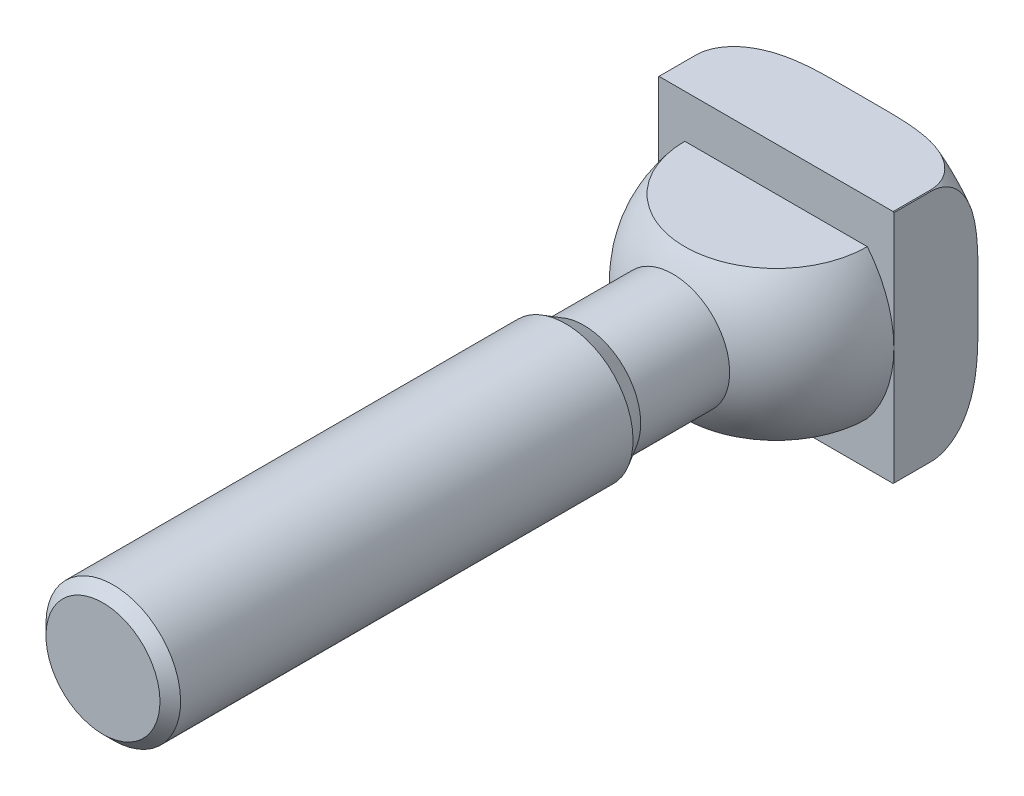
ISO-10303-21;
HEADER;
FILE_DESCRIPTION(('STEP AP214'),'2;1');
FILE_NAME('part.step','',(''),(''),'','','');
FILE_SCHEMA(('AUTOMOTIVE_DESIGN { 1 0 10303 214 1 1 1 1 }'));
ENDSEC;
DATA;
#1=APPLICATION_CONTEXT('core data for automotive mechanical design processes');
#2=APPLICATION_PROTOCOL_DEFINITION('international standard','automotive_design',2000,#1);
#3=PRODUCT_CONTEXT('',#1,'mechanical');
#4=PRODUCT('Part','Part','',(#3));
#5=PRODUCT_RELATED_PRODUCT_CATEGORY('part','',(#4));
#6=PRODUCT_DEFINITION_FORMATION('','',#4);
#7=PRODUCT_DEFINITION_CONTEXT('part definition',#1,'design');
#8=PRODUCT_DEFINITION('design','',#6,#7);
#9=PRODUCT_DEFINITION_SHAPE('','',#8);
#10=(LENGTH_UNIT() NAMED_UNIT(*) SI_UNIT(.MILLI.,.METRE.));
#11=(NAMED_UNIT(*) PLANE_ANGLE_UNIT() SI_UNIT($,.RADIAN.));
#12=(NAMED_UNIT(*) SI_UNIT($,.STERADIAN.) SOLID_ANGLE_UNIT());
#13=UNCERTAINTY_MEASURE_WITH_UNIT(LENGTH_MEASURE(1.E-05),#10,'distance_accuracy_value','');
#14=(GEOMETRIC_REPRESENTATION_CONTEXT(3) GLOBAL_UNCERTAINTY_ASSIGNED_CONTEXT((#13)) GLOBAL_UNIT_ASSIGNED_CONTEXT((#10,
#11,#12)) REPRESENTATION_CONTEXT('',''));
#15=CARTESIAN_POINT('',(0.,0.,0.));
#16=DIRECTION('',(0.,0.,1.));
#17=DIRECTION('',(1.,0.,0.));
#18=AXIS2_PLACEMENT_3D('',#15,#16,#17);
#19=CARTESIAN_POINT('',(0.,0.,-4.4));
#20=DIRECTION('',(0.,0.,1.));
#21=DIRECTION('',(0.,1.,0.));
#22=AXIS2_PLACEMENT_3D('',#19,#20,#21);
#23=TOROIDAL_SURFACE('',#22,14.14,5.6);
#24=CARTESIAN_POINT('',(-14.,0.,-9.99824972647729));
#25=CARTESIAN_POINT('',(-14.,-0.310759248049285,-9.99825085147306));
#26=CARTESIAN_POINT('',(-14.,-0.621518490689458,-9.99853784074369));
#27=CARTESIAN_POINT('',(-14.,-1.24303661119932,-9.99934060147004));
#28=CARTESIAN_POINT('',(-14.,-1.55379548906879,-9.99985637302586));
#29=CARTESIAN_POINT('',(-14.,-2.17555675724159,-10.0000957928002));
#30=CARTESIAN_POINT('',(-14.,-2.48655914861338,-9.99981882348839));
#31=CARTESIAN_POINT('',(-14.,-3.10856376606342,-9.99683999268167));
#32=CARTESIAN_POINT('',(-14.,-3.41956599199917,-9.99413807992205));
#33=CARTESIAN_POINT('',(-14.,-4.04142447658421,-9.98415314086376));
#34=CARTESIAN_POINT('',(-14.,-4.35228075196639,-9.97687135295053));
#35=CARTESIAN_POINT('',(-14.,-4.97375164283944,-9.95513103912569));
#36=CARTESIAN_POINT('',(-14.,-5.28436626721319,-9.94067279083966));
#37=CARTESIAN_POINT('',(-14.,-5.90457312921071,-9.90163480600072));
#38=CARTESIAN_POINT('',(-14.,-6.21416618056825,-9.87706873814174));
#39=CARTESIAN_POINT('',(-14.,-6.83210242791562,-9.8145243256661));
#40=CARTESIAN_POINT('',(-14.,-7.14044538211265,-9.77654350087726));
#41=CARTESIAN_POINT('',(-14.,-7.76037724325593,-9.68271738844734));
#42=CARTESIAN_POINT('',(-14.,-8.07191904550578,-9.62655135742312));
#43=CARTESIAN_POINT('',(-14.,-8.69023154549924,-9.49254678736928));
#44=CARTESIAN_POINT('',(-14.,-8.99700487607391,-9.41472069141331));
#45=CARTESIAN_POINT('',(-14.,-9.60149117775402,-9.23352582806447));
#46=CARTESIAN_POINT('',(-14.,-9.89923995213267,-9.13027881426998));
#47=CARTESIAN_POINT('',(-14.,-10.4824504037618,-8.89388231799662));
#48=CARTESIAN_POINT('',(-14.,-10.7679262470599,-8.76076847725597));
#49=CARTESIAN_POINT('',(-14.,-11.3136573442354,-8.46441782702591));
#50=CARTESIAN_POINT('',(-14.,-11.5743689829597,-8.30203188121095));
#51=CARTESIAN_POINT('',(-14.,-12.0709995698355,-7.94177662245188));
#52=CARTESIAN_POINT('',(-14.,-12.3068984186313,-7.74387888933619));
#53=CARTESIAN_POINT('',(-14.,-12.63518165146,-7.4188785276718));
#54=CARTESIAN_POINT('',(-14.,-12.7408989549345,-7.30509090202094));
#55=CARTESIAN_POINT('',(-14.,-12.9416863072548,-7.06851889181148));
#56=CARTESIAN_POINT('',(-14.,-13.0367621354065,-6.94573945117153));
#57=CARTESIAN_POINT('',(-14.,-13.2145748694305,-6.6917702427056));
#58=CARTESIAN_POINT('',(-14.,-13.2973291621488,-6.56059270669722));
#59=CARTESIAN_POINT('',(-14.,-13.4490161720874,-6.2905462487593));
#60=CARTESIAN_POINT('',(-14.,-13.5179540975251,-6.15168025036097));
#61=CARTESIAN_POINT('',(-14.,-13.6697783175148,-5.79932831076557));
#62=CARTESIAN_POINT('',(-14.,-13.7436357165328,-5.58184122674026));
#63=CARTESIAN_POINT('',(-14.,-13.8537149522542,-5.13762264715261));
#64=CARTESIAN_POINT('',(-14.,-13.8899558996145,-4.91089590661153));
#65=CARTESIAN_POINT('',(-14.,-13.9227119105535,-4.45413617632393));
#66=CARTESIAN_POINT('',(-14.,-13.9191559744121,-4.22409800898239));
#67=CARTESIAN_POINT('',(-14.,-13.8723552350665,-3.76811077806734));
#68=CARTESIAN_POINT('',(-14.,-13.8291052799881,-3.54216224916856));
#69=CARTESIAN_POINT('',(-14.,-13.7070151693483,-3.10597064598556));
#70=CARTESIAN_POINT('',(-14.,-13.6290387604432,-2.89548280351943));
#71=CARTESIAN_POINT('',(-14.,-13.4418093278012,-2.48903531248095));
#72=CARTESIAN_POINT('',(-14.,-13.3325526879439,-2.29307734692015));
#73=CARTESIAN_POINT('',(-14.,-13.0760306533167,-1.90105488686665));
#74=CARTESIAN_POINT('',(-14.,-12.9261604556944,-1.70670634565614));
#75=CARTESIAN_POINT('',(-14.,-12.6009114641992,-1.34062905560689));
#76=CARTESIAN_POINT('',(-14.,-12.425510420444,-1.16892028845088));
#77=CARTESIAN_POINT('',(-14.,-12.0933369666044,-0.881603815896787));
#78=CARTESIAN_POINT('',(-14.,-11.9401944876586,-0.76173253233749));
#79=CARTESIAN_POINT('',(-14.,-11.6238593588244,-0.535952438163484));
#80=CARTESIAN_POINT('',(-14.,-11.4606616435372,-0.430050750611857));
#81=CARTESIAN_POINT('',(-14.,-11.1262197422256,-0.231514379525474));
#82=CARTESIAN_POINT('',(-14.,-10.9549677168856,-0.138892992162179));
#83=CARTESIAN_POINT('',(-14.,-10.6063402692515,0.0338060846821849));
#84=CARTESIAN_POINT('',(-14.,-10.428965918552,0.113885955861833));
#85=CARTESIAN_POINT('',(-14.,-9.95291874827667,0.3106674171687));
#86=CARTESIAN_POINT('',(-14.,-9.65013791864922,0.41746585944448));
#87=CARTESIAN_POINT('',(-14.,-9.03638107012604,0.604202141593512));
#88=CARTESIAN_POINT('',(-14.,-8.72539881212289,0.684118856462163));
#89=CARTESIAN_POINT('',(-14.,-8.09734857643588,0.821773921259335));
#90=CARTESIAN_POINT('',(-14.,-7.78026113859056,0.879421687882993));
#91=CARTESIAN_POINT('',(-14.,-7.14352292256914,0.976351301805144));
#92=CARTESIAN_POINT('',(-14.,-6.82387330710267,1.01564104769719));
#93=CARTESIAN_POINT('',(-14.,-6.08602362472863,1.08964790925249));
#94=CARTESIAN_POINT('',(-14.,-5.66733893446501,1.1193635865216));
#95=CARTESIAN_POINT('',(-14.,-4.82908628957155,1.16245287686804));
#96=CARTESIAN_POINT('',(-14.,-4.40951805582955,1.17582016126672));
#97=CARTESIAN_POINT('',(-14.,-3.56968565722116,1.19303029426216));
#98=CARTESIAN_POINT('',(-14.,-3.14942129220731,1.19686084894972));
#99=CARTESIAN_POINT('',(-14.,-2.30895829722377,1.20041358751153));
#100=CARTESIAN_POINT('',(-14.,-1.88875966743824,1.20013642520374));
#101=CARTESIAN_POINT('',(-14.,-1.04864396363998,1.19915092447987));
#102=CARTESIAN_POINT('',(-14.,-0.628726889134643,1.19844287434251));
#103=CARTESIAN_POINT('',(-14.,0.21112726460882,1.19813401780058));
#104=CARTESIAN_POINT('',(-14.,0.631064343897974,1.19853326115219));
#105=CARTESIAN_POINT('',(-14.,1.47068212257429,1.19965885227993));
#106=CARTESIAN_POINT('',(-14.,1.89036282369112,1.20038500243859));
#107=CARTESIAN_POINT('',(-14.,2.72971643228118,1.19918094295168));
#108=CARTESIAN_POINT('',(-14.,3.14938933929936,1.19725084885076));
#109=CARTESIAN_POINT('',(-14.,3.72184106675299,1.18945550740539));
#110=CARTESIAN_POINT('',(-14.,3.87466005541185,1.18687249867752));
#111=CARTESIAN_POINT('',(-14.,4.18027065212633,1.18040049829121));
#112=CARTESIAN_POINT('',(-14.,4.33306226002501,1.17651149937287));
#113=CARTESIAN_POINT('',(-14.,4.79139482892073,1.16242966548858));
#114=CARTESIAN_POINT('',(-14.,5.09687074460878,1.14982221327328));
#115=CARTESIAN_POINT('',(-14.,5.70773033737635,1.11539646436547));
#116=CARTESIAN_POINT('',(-14.,6.01311337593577,1.0935661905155));
#117=CARTESIAN_POINT('',(-14.,6.62278129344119,1.03760824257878));
#118=CARTESIAN_POINT('',(-14.,6.92706622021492,1.0034811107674));
#119=CARTESIAN_POINT('',(-14.,7.53756680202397,0.919002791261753));
#120=CARTESIAN_POINT('',(-14.,7.84375430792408,0.868441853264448));
#121=CARTESIAN_POINT('',(-14.,8.45235679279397,0.747440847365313));
#122=CARTESIAN_POINT('',(-14.,8.75477072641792,0.676995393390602));
#123=CARTESIAN_POINT('',(-14.,9.35221826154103,0.512485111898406));
#124=CARTESIAN_POINT('',(-14.,9.64727195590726,0.418494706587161));
#125=CARTESIAN_POINT('',(-14.,10.2269376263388,0.202797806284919));
#126=CARTESIAN_POINT('',(-14.,10.5115593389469,0.0811179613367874));
#127=CARTESIAN_POINT('',(-14.,11.073245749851,-0.197865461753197));
#128=CARTESIAN_POINT('',(-14.,11.3498592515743,-0.356091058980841));
#129=CARTESIAN_POINT('',(-14.,11.8788610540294,-0.709917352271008));
#130=CARTESIAN_POINT('',(-14.,12.1312420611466,-0.905529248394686));
#131=CARTESIAN_POINT('',(-14.,12.4845698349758,-1.22925474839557));
#132=CARTESIAN_POINT('',(-14.,12.5987850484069,-1.34304039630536));
#133=CARTESIAN_POINT('',(-14.,12.8164661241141,-1.58042428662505));
#134=CARTESIAN_POINT('',(-14.,12.9199380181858,-1.70401695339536));
#135=CARTESIAN_POINT('',(-14.,13.1142800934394,-1.9605135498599));
#136=CARTESIAN_POINT('',(-14.,13.205167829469,-2.09340411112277));
#137=CARTESIAN_POINT('',(-14.,13.372664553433,-2.36782024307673));
#138=CARTESIAN_POINT('',(-14.,13.4492796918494,-2.50934205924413));
#139=CARTESIAN_POINT('',(-14.,13.6163411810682,-2.86319975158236));
#140=CARTESIAN_POINT('',(-14.,13.6983634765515,-3.07961651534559));
#141=CARTESIAN_POINT('',(-14.,13.824923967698,-3.52306568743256));
#142=CARTESIAN_POINT('',(-14.,13.8694841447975,-3.75009178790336));
#143=CARTESIAN_POINT('',(-14.,13.9185610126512,-4.2090333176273));
#144=CARTESIAN_POINT('',(-14.,13.9229835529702,-4.44095896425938));
#145=CARTESIAN_POINT('',(-14.,13.8912351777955,-4.90200336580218));
#146=CARTESIAN_POINT('',(-14.,13.8550611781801,-5.13112190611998));
#147=CARTESIAN_POINT('',(-14.,13.7462858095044,-5.5721594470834));
#148=CARTESIAN_POINT('',(-14.,13.6749635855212,-5.78439832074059));
#149=CARTESIAN_POINT('',(-14.,13.5003447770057,-6.19518406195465));
#150=CARTESIAN_POINT('',(-14.,13.3970432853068,-6.39372882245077));
#151=CARTESIAN_POINT('',(-14.,13.1534590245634,-6.78957755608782));
#152=CARTESIAN_POINT('',(-14.,13.0108272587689,-6.98542587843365));
#153=CARTESIAN_POINT('',(-14.,12.6995996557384,-7.35524295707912));
#154=CARTESIAN_POINT('',(-14.,12.5309874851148,-7.52919782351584));
#155=CARTESIAN_POINT('',(-14.,12.2128466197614,-7.81886907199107));
#156=CARTESIAN_POINT('',(-14.,12.0672621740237,-7.93898454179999));
#157=CARTESIAN_POINT('',(-14.,11.7660321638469,-8.16591189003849));
#158=CARTESIAN_POINT('',(-14.,11.6103820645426,-8.272717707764));
#159=CARTESIAN_POINT('',(-14.,11.1309674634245,-8.57419374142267));
#160=CARTESIAN_POINT('',(-14.,10.7950194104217,-8.74967609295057));
#161=CARTESIAN_POINT('',(-14.,10.1706537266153,-9.02589055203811));
#162=CARTESIAN_POINT('',(-14.,9.88556746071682,-9.13451214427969));
#163=CARTESIAN_POINT('',(-14.,9.30681398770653,-9.32642336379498));
#164=CARTESIAN_POINT('',(-14.,9.01314069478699,-9.40969452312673));
#165=CARTESIAN_POINT('',(-14.,8.42011381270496,-9.55475710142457));
#166=CARTESIAN_POINT('',(-14.,8.12075104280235,-9.61651002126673));
#167=CARTESIAN_POINT('',(-14.,7.51883351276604,-9.72211873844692));
#168=CARTESIAN_POINT('',(-14.,7.21627753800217,-9.76596745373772));
#169=CARTESIAN_POINT('',(-14.,6.6268227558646,-9.83715592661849));
#170=CARTESIAN_POINT('',(-14.,6.34001723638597,-9.86529590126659));
#171=CARTESIAN_POINT('',(-14.,5.76566600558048,-9.91149411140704));
#172=CARTESIAN_POINT('',(-14.,5.47812040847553,-9.92955381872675));
#173=CARTESIAN_POINT('',(-14.,4.90241848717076,-9.95811498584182));
#174=CARTESIAN_POINT('',(-14.,4.61426184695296,-9.96860968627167));
#175=CARTESIAN_POINT('',(-14.,4.0378073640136,-9.98427067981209));
#176=CARTESIAN_POINT('',(-14.,3.74950951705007,-9.98943680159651));
#177=CARTESIAN_POINT('',(-14.,3.17268829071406,-9.99640544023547));
#178=CARTESIAN_POINT('',(-14.,2.88416488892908,-9.99820571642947));
#179=CARTESIAN_POINT('',(-14.,2.30711989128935,-10.0000585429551));
#180=CARTESIAN_POINT('',(-14.,2.01859829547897,-10.0001111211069));
#181=CARTESIAN_POINT('',(-14.,1.44173081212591,-9.99968852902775));
#182=CARTESIAN_POINT('',(-14.,1.1533849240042,-9.99921367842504));
#183=CARTESIAN_POINT('',(-14.,0.576692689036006,-9.99849375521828));
#184=CARTESIAN_POINT('',(-14.,0.2883463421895,-9.99824868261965));
#185=CARTESIAN_POINT('',(-14.,0.,-9.99824972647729));
#186=B_SPLINE_CURVE_WITH_KNOTS('',3,(#24,#25,#26,#27,#28,#29,#30,#31,#32,#33,#34,#35,#36,#37,
#38,#39,#40,#41,#42,#43,#44,#45,#46,#47,#48,#49,#50,#51,#52,#53,#54,#55,#56,#57,#58,#59,#60,#61,
#62,#63,#64,#65,#66,#67,#68,#69,#70,#71,#72,#73,#74,#75,#76,#77,#78,#79,#80,#81,#82,#83,#84,#85,
#86,#87,#88,#89,#90,#91,#92,#93,#94,#95,#96,#97,#98,#99,#100,#101,#102,#103,#104,#105,#106,#107,
#108,#109,#110,#111,#112,#113,#114,#115,#116,#117,#118,#119,#120,#121,#122,#123,#124,#125,#126,
#127,#128,#129,#130,#131,#132,#133,#134,#135,#136,#137,#138,#139,#140,#141,#142,#143,#144,#145,
#146,#147,#148,#149,#150,#151,#152,#153,#154,#155,#156,#157,#158,#159,#160,#161,#162,#163,#164,
#165,#166,#167,#168,#169,#170,#171,#172,#173,#174,#175,#176,#177,#178,#179,#180,#181,#182,#183,
#184,#185),.UNSPECIFIED.,.T.,.F.,(4,2,2,2,2,2,2,2,2,2,2,2,2,2,2,2,2,2,2,2,2,2,2,2,2,2,2,2,2,2,2,
2,2,2,2,2,2,2,2,2,2,2,2,2,2,2,2,2,2,2,2,2,2,2,2,2,2,2,2,2,2,2,2,2,2,2,2,2,2,2,2,2,2,2,2,2,2,2,2,
2,4),(0.,0.932277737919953,1.86455588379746,2.79756045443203,3.73058474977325,4.66335686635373,
5.59609290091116,6.52757173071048,7.45922286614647,8.40829357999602,9.35682020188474,
10.3008893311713,11.2438377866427,12.1628389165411,13.0825788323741,13.5480143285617,
14.0131958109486,14.4777145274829,14.9420578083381,15.6278649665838,16.3133235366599,
17.0000051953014,17.6867759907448,18.3573439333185,19.0279894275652,19.7615747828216,
20.4958033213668,21.0784512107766,21.6613950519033,22.2449185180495,22.8283403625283,
23.7898904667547,24.7521944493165,25.7183725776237,26.6841346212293,27.9428211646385,
29.2019948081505,30.4627908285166,31.7233861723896,32.9831390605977,34.2429485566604,
35.5019975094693,36.7609916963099,37.2195087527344,37.6780283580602,38.5951359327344,
39.5134381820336,40.4316999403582,41.3621750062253,42.2929023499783,43.220724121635,
44.1476566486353,45.1011871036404,46.0550036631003,46.5381223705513,47.0209683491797,
47.5031338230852,47.985091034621,48.676179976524,49.3668631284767,50.0591659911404,
50.7515214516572,51.4203582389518,52.089297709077,52.8134628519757,53.5380851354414,
54.1035302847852,54.6692319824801,55.8017422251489,56.7158020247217,57.6305261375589,
58.5468785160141,59.4635930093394,60.3279216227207,61.1921240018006,62.0570975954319,
62.9220989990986,63.7876760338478,64.6532392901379,65.5182782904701,66.3833173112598),.UNSPECIFIED.);
#187=CARTESIAN_POINT('',(-14.,-1.98484256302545,-10.));
#188=VERTEX_POINT('',#187);
#189=CARTESIAN_POINT('',(-14.,-13.916450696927,-4.4));
#190=VERTEX_POINT('',#189);
#191=EDGE_CURVE('E140',#188,#190,#186,.T.);
#192=ORIENTED_EDGE('',*,*,#191,.F.);
#193=CARTESIAN_POINT('',(0.,0.,-10.));
#194=DIRECTION('',(0.,0.,1.));
#195=DIRECTION('',(0.,1.,0.));
#196=AXIS2_PLACEMENT_3D('',#193,#194,#195);
#197=CIRCLE('',#196,14.14);
#198=CARTESIAN_POINT('',(-1.98484256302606,-14.,-10.));
#199=VERTEX_POINT('',#198);
#200=EDGE_CURVE('E239',#188,#199,#197,.T.);
#201=ORIENTED_EDGE('',*,*,#200,.T.);
#202=CARTESIAN_POINT('',(0.,-14.,-9.99824972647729));
#203=CARTESIAN_POINT('',(0.310759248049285,-14.,-9.99825085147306));
#204=CARTESIAN_POINT('',(0.621518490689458,-14.,-9.99853784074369));
#205=CARTESIAN_POINT('',(1.24303661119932,-14.,-9.99934060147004));
#206=CARTESIAN_POINT('',(1.55379548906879,-14.,-9.99985637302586));
#207=CARTESIAN_POINT('',(2.17555675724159,-14.,-10.0000957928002));
#208=CARTESIAN_POINT('',(2.48655914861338,-14.,-9.99981882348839));
#209=CARTESIAN_POINT('',(3.10856376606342,-14.,-9.99683999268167));
#210=CARTESIAN_POINT('',(3.41956599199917,-14.,-9.99413807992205));
#211=CARTESIAN_POINT('',(4.04142447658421,-14.,-9.98415314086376));
#212=CARTESIAN_POINT('',(4.35228075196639,-14.,-9.97687135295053));
#213=CARTESIAN_POINT('',(4.97375164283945,-14.,-9.95513103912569));
#214=CARTESIAN_POINT('',(5.28436626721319,-14.,-9.94067279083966));
#215=CARTESIAN_POINT('',(5.90457312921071,-14.,-9.90163480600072));
#216=CARTESIAN_POINT('',(6.21416618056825,-14.,-9.87706873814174));
#217=CARTESIAN_POINT('',(6.83210242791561,-14.,-9.8145243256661));
#218=CARTESIAN_POINT('',(7.14044538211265,-14.,-9.77654350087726));
#219=CARTESIAN_POINT('',(7.76037724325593,-14.,-9.68271738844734));
#220=CARTESIAN_POINT('',(8.07191904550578,-14.,-9.62655135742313));
#221=CARTESIAN_POINT('',(8.69023154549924,-14.,-9.49254678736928));
#222=CARTESIAN_POINT('',(8.99700487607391,-14.,-9.41472069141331));
#223=CARTESIAN_POINT('',(9.60149117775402,-14.,-9.23352582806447));
#224=CARTESIAN_POINT('',(9.89923995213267,-14.,-9.13027881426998));
#225=CARTESIAN_POINT('',(10.4824504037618,-14.,-8.89388231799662));
#226=CARTESIAN_POINT('',(10.7679262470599,-14.,-8.76076847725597));
#227=CARTESIAN_POINT('',(11.3136573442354,-14.,-8.46441782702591));
#228=CARTESIAN_POINT('',(11.5743689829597,-14.,-8.30203188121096));
#229=CARTESIAN_POINT('',(12.0709995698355,-14.,-7.94177662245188));
#230=CARTESIAN_POINT('',(12.3068984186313,-14.,-7.74387888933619));
#231=CARTESIAN_POINT('',(12.63518165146,-14.,-7.4188785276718));
#232=CARTESIAN_POINT('',(12.7408989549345,-14.,-7.30509090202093));
#233=CARTESIAN_POINT('',(12.9416863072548,-14.,-7.06851889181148));
#234=CARTESIAN_POINT('',(13.0367621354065,-14.,-6.94573945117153));
#235=CARTESIAN_POINT('',(13.2145748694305,-14.,-6.69177024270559));
#236=CARTESIAN_POINT('',(13.2973291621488,-14.,-6.56059270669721));
#237=CARTESIAN_POINT('',(13.4490161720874,-14.,-6.2905462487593));
#238=CARTESIAN_POINT('',(13.5179540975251,-14.,-6.15168025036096));
#239=CARTESIAN_POINT('',(13.6697783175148,-14.,-5.79932831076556));
#240=CARTESIAN_POINT('',(13.7436357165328,-14.,-5.58184122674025));
#241=CARTESIAN_POINT('',(13.8537149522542,-14.,-5.13762264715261));
#242=CARTESIAN_POINT('',(13.8899558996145,-14.,-4.91089590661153));
#243=CARTESIAN_POINT('',(13.9227119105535,-14.,-4.45413617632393));
#244=CARTESIAN_POINT('',(13.9191559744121,-14.,-4.22409800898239));
#245=CARTESIAN_POINT('',(13.8723552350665,-14.,-3.76811077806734));
#246=CARTESIAN_POINT('',(13.8291052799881,-14.,-3.54216224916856));
#247=CARTESIAN_POINT('',(13.7070151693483,-14.,-3.10597064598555));
#248=CARTESIAN_POINT('',(13.6290387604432,-14.,-2.89548280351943));
#249=CARTESIAN_POINT('',(13.4418093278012,-14.,-2.48903531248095));
#250=CARTESIAN_POINT('',(13.3325526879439,-14.,-2.29307734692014));
#251=CARTESIAN_POINT('',(13.0760306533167,-14.,-1.90105488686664));
#252=CARTESIAN_POINT('',(12.9261604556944,-14.,-1.70670634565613));
#253=CARTESIAN_POINT('',(12.6009114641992,-14.,-1.34062905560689));
#254=CARTESIAN_POINT('',(12.425510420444,-14.,-1.16892028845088));
#255=CARTESIAN_POINT('',(12.0933369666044,-14.,-0.881603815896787));
#256=CARTESIAN_POINT('',(11.9401944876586,-14.,-0.76173253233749));
#257=CARTESIAN_POINT('',(11.6238593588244,-14.,-0.535952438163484));
#258=CARTESIAN_POINT('',(11.4606616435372,-14.,-0.430050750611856));
#259=CARTESIAN_POINT('',(11.1262197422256,-14.,-0.231514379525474));
#260=CARTESIAN_POINT('',(10.9549677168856,-14.,-0.138892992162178));
#261=CARTESIAN_POINT('',(10.6063402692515,-14.,0.0338060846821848));
#262=CARTESIAN_POINT('',(10.428965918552,-14.,0.113885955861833));
#263=CARTESIAN_POINT('',(9.95291874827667,-14.,0.3106674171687));
#264=CARTESIAN_POINT('',(9.65013791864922,-14.,0.417465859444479));
#265=CARTESIAN_POINT('',(9.03638107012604,-14.,0.604202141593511));
#266=CARTESIAN_POINT('',(8.72539881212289,-14.,0.684118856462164));
#267=CARTESIAN_POINT('',(8.09734857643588,-14.,0.821773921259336));
#268=CARTESIAN_POINT('',(7.78026113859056,-14.,0.879421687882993));
#269=CARTESIAN_POINT('',(7.14352292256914,-14.,0.976351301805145));
#270=CARTESIAN_POINT('',(6.82387330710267,-14.,1.01564104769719));
#271=CARTESIAN_POINT('',(6.08602362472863,-14.,1.08964790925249));
#272=CARTESIAN_POINT('',(5.66733893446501,-14.,1.1193635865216));
#273=CARTESIAN_POINT('',(4.82908628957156,-14.,1.16245287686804));
#274=CARTESIAN_POINT('',(4.40951805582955,-14.,1.17582016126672));
#275=CARTESIAN_POINT('',(3.56968565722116,-14.,1.19303029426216));
#276=CARTESIAN_POINT('',(3.14942129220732,-14.,1.19686084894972));
#277=CARTESIAN_POINT('',(2.30895829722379,-14.,1.20041358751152));
#278=CARTESIAN_POINT('',(1.88875966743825,-14.,1.20013642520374));
#279=CARTESIAN_POINT('',(1.04864396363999,-14.,1.19915092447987));
#280=CARTESIAN_POINT('',(0.628726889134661,-14.,1.19844287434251));
#281=CARTESIAN_POINT('',(-0.211127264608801,-14.,1.19813401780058));
#282=CARTESIAN_POINT('',(-0.631064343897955,-14.,1.19853326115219));
#283=CARTESIAN_POINT('',(-1.47068212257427,-14.,1.19965885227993));
#284=CARTESIAN_POINT('',(-1.89036282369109,-14.,1.20038500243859));
#285=CARTESIAN_POINT('',(-2.72971643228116,-14.,1.19918094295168));
#286=CARTESIAN_POINT('',(-3.14938933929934,-14.,1.19725084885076));
#287=CARTESIAN_POINT('',(-3.72184106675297,-14.,1.18945550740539));
#288=CARTESIAN_POINT('',(-3.87466005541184,-14.,1.18687249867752));
#289=CARTESIAN_POINT('',(-4.18027065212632,-14.,1.18040049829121));
#290=CARTESIAN_POINT('',(-4.333062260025,-14.,1.17651149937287));
#291=CARTESIAN_POINT('',(-4.79139482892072,-14.,1.16242966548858));
#292=CARTESIAN_POINT('',(-5.09687074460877,-14.,1.14982221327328));
#293=CARTESIAN_POINT('',(-5.70773033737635,-14.,1.11539646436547));
#294=CARTESIAN_POINT('',(-6.01311337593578,-14.,1.0935661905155));
#295=CARTESIAN_POINT('',(-6.62278129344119,-14.,1.03760824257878));
#296=CARTESIAN_POINT('',(-6.92706622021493,-14.,1.0034811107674));
#297=CARTESIAN_POINT('',(-7.53756680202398,-14.,0.919002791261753));
#298=CARTESIAN_POINT('',(-7.8437543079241,-14.,0.868441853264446));
#299=CARTESIAN_POINT('',(-8.45235679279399,-14.,0.747440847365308));
#300=CARTESIAN_POINT('',(-8.75477072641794,-14.,0.676995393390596));
#301=CARTESIAN_POINT('',(-9.35221826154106,-14.,0.512485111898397));
#302=CARTESIAN_POINT('',(-9.64727195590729,-14.,0.41849470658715));
#303=CARTESIAN_POINT('',(-10.2269376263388,-14.,0.202797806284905));
#304=CARTESIAN_POINT('',(-10.5115593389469,-14.,0.081117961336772));
#305=CARTESIAN_POINT('',(-11.0732457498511,-14.,-0.197865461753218));
#306=CARTESIAN_POINT('',(-11.3498592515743,-14.,-0.356091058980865));
#307=CARTESIAN_POINT('',(-11.8788610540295,-14.,-0.709917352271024));
#308=CARTESIAN_POINT('',(-12.1312420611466,-14.,-0.905529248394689));
#309=CARTESIAN_POINT('',(-12.4845698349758,-14.,-1.22925474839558));
#310=CARTESIAN_POINT('',(-12.5987850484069,-14.,-1.34304039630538));
#311=CARTESIAN_POINT('',(-12.8164661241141,-14.,-1.58042428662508));
#312=CARTESIAN_POINT('',(-12.9199380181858,-14.,-1.70401695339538));
#313=CARTESIAN_POINT('',(-13.1142800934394,-14.,-1.96051354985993));
#314=CARTESIAN_POINT('',(-13.205167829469,-14.,-2.09340411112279));
#315=CARTESIAN_POINT('',(-13.372664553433,-14.,-2.36782024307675));
#316=CARTESIAN_POINT('',(-13.4492796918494,-14.,-2.50934205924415));
#317=CARTESIAN_POINT('',(-13.6163411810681,-14.,-2.86319975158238));
#318=CARTESIAN_POINT('',(-13.6983634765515,-14.,-3.07961651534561));
#319=CARTESIAN_POINT('',(-13.824923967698,-14.,-3.52306568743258));
#320=CARTESIAN_POINT('',(-13.8694841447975,-14.,-3.75009178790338));
#321=CARTESIAN_POINT('',(-13.9185610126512,-14.,-4.20903331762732));
#322=CARTESIAN_POINT('',(-13.9229835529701,-14.,-4.4409589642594));
#323=CARTESIAN_POINT('',(-13.8912351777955,-14.,-4.9020033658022));
#324=CARTESIAN_POINT('',(-13.8550611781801,-14.,-5.13112190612));
#325=CARTESIAN_POINT('',(-13.7462858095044,-14.,-5.57215944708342));
#326=CARTESIAN_POINT('',(-13.6749635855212,-14.,-5.78439832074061));
#327=CARTESIAN_POINT('',(-13.5003447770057,-14.,-6.19518406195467));
#328=CARTESIAN_POINT('',(-13.3970432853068,-14.,-6.39372882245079));
#329=CARTESIAN_POINT('',(-13.1534590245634,-14.,-6.78957755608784));
#330=CARTESIAN_POINT('',(-13.0108272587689,-14.,-6.98542587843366));
#331=CARTESIAN_POINT('',(-12.6995996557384,-14.,-7.35524295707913));
#332=CARTESIAN_POINT('',(-12.5309874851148,-14.,-7.52919782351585));
#333=CARTESIAN_POINT('',(-12.2128466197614,-14.,-7.81886907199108));
#334=CARTESIAN_POINT('',(-12.0672621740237,-14.,-7.93898454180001));
#335=CARTESIAN_POINT('',(-11.7660321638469,-14.,-8.16591189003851));
#336=CARTESIAN_POINT('',(-11.6103820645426,-14.,-8.27271770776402));
#337=CARTESIAN_POINT('',(-11.1309674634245,-14.,-8.57419374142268));
#338=CARTESIAN_POINT('',(-10.7950194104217,-14.,-8.74967609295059));
#339=CARTESIAN_POINT('',(-10.1706537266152,-14.,-9.02589055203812));
#340=CARTESIAN_POINT('',(-9.88556746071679,-14.,-9.1345121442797));
#341=CARTESIAN_POINT('',(-9.3068139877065,-14.,-9.32642336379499));
#342=CARTESIAN_POINT('',(-9.01314069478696,-14.,-9.40969452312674));
#343=CARTESIAN_POINT('',(-8.42011381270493,-14.,-9.55475710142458));
#344=CARTESIAN_POINT('',(-8.12075104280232,-14.,-9.61651002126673));
#345=CARTESIAN_POINT('',(-7.518833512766,-14.,-9.72211873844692));
#346=CARTESIAN_POINT('',(-7.21627753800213,-14.,-9.76596745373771));
#347=CARTESIAN_POINT('',(-6.62682275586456,-14.,-9.83715592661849));
#348=CARTESIAN_POINT('',(-6.34001723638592,-14.,-9.86529590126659));
#349=CARTESIAN_POINT('',(-5.76566600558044,-14.,-9.91149411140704));
#350=CARTESIAN_POINT('',(-5.4781204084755,-14.,-9.92955381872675));
#351=CARTESIAN_POINT('',(-4.90241848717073,-14.,-9.95811498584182));
#352=CARTESIAN_POINT('',(-4.61426184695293,-14.,-9.96860968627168));
#353=CARTESIAN_POINT('',(-4.03780736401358,-14.,-9.98427067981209));
#354=CARTESIAN_POINT('',(-3.74950951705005,-14.,-9.98943680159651));
#355=CARTESIAN_POINT('',(-3.17268829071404,-14.,-9.99640544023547));
#356=CARTESIAN_POINT('',(-2.88416488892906,-14.,-9.99820571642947));
#357=CARTESIAN_POINT('',(-2.30711989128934,-14.,-10.0000585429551));
#358=CARTESIAN_POINT('',(-2.01859829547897,-14.,-10.0001111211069));
#359=CARTESIAN_POINT('',(-1.4417308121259,-14.,-9.99968852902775));
#360=CARTESIAN_POINT('',(-1.1533849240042,-14.,-9.99921367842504));
#361=CARTESIAN_POINT('',(-0.576692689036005,-14.,-9.99849375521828));
#362=CARTESIAN_POINT('',(-0.2883463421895,-14.,-9.99824868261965));
#363=CARTESIAN_POINT('',(0.,-14.,-9.99824972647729));
#364=B_SPLINE_CURVE_WITH_KNOTS('',3,(#202,#203,#204,#205,#206,#207,#208,#209,#210,#211,#212,
#213,#214,#215,#216,#217,#218,#219,#220,#221,#222,#223,#224,#225,#226,#227,#228,#229,#230,#231,
#232,#233,#234,#235,#236,#237,#238,#239,#240,#241,#242,#243,#244,#245,#246,#247,#248,#249,#250,
#251,#252,#253,#254,#255,#256,#257,#258,#259,#260,#261,#262,#263,#264,#265,#266,#267,#268,#269,
#270,#271,#272,#273,#274,#275,#276,#277,#278,#279,#280,#281,#282,#283,#284,#285,#286,#287,#288,
#289,#290,#291,#292,#293,#294,#295,#296,#297,#298,#299,#300,#301,#302,#303,#304,#305,#306,#307,
#308,#309,#310,#311,#312,#313,#314,#315,#316,#317,#318,#319,#320,#321,#322,#323,#324,#325,#326,
#327,#328,#329,#330,#331,#332,#333,#334,#335,#336,#337,#338,#339,#340,#341,#342,#343,#344,#345,
#346,#347,#348,#349,#350,#351,#352,#353,#354,#355,#356,#357,#358,#359,#360,#361,#362,#363),
.UNSPECIFIED.,.T.,.F.,(4,2,2,2,2,2,2,2,2,2,2,2,2,2,2,2,2,2,2,2,2,2,2,2,2,2,2,2,2,2,2,2,2,2,2,2,
2,2,2,2,2,2,2,2,2,2,2,2,2,2,2,2,2,2,2,2,2,2,2,2,2,2,2,2,2,2,2,2,2,2,2,2,2,2,2,2,2,2,2,2,4),(0.,
0.932277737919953,1.86455588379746,2.79756045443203,3.73058474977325,4.66335686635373,
5.59609290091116,6.52757173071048,7.45922286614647,8.40829357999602,9.35682020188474,
10.3008893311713,11.2438377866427,12.1628389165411,13.0825788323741,13.5480143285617,
14.0131958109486,14.4777145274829,14.9420578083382,15.6278649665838,16.3133235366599,
17.0000051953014,17.6867759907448,18.3573439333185,19.0279894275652,19.7615747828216,
20.4958033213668,21.0784512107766,21.6613950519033,22.2449185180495,22.8283403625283,
23.7898904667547,24.7521944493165,25.7183725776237,26.6841346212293,27.9428211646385,
29.2019948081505,30.4627908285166,31.7233861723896,32.9831390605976,34.2429485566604,
35.5019975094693,36.7609916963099,37.2195087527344,37.6780283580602,38.5951359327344,
39.5134381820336,40.4316999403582,41.3621750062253,42.2929023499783,43.220724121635,
44.1476566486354,45.1011871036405,46.0550036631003,46.5381223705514,47.0209683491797,
47.5031338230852,47.9850910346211,48.676179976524,49.3668631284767,50.0591659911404,
50.7515214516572,51.4203582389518,52.089297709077,52.8134628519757,53.5380851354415,
54.1035302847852,54.6692319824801,55.8017422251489,56.7158020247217,57.6305261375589,
58.5468785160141,59.4635930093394,60.3279216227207,61.1921240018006,62.0570975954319,
62.9220989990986,63.7876760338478,64.6532392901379,65.5182782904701,66.3833173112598),.UNSPECIFIED.);
#365=CARTESIAN_POINT('',(-13.916450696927,-14.,-4.4));
#366=VERTEX_POINT('',#365);
#367=EDGE_CURVE('E177',#366,#199,#364,.T.);
#368=ORIENTED_EDGE('',*,*,#367,.F.);
#369=CARTESIAN_POINT('',(0.,0.,-4.4));
#370=DIRECTION('',(0.,0.,1.));
#371=DIRECTION('',(0.,1.,0.));
#372=AXIS2_PLACEMENT_3D('',#369,#370,#371);
#373=CIRCLE('',#372,19.74);
#374=EDGE_CURVE('E174',#190,#366,#373,.T.);
#375=ORIENTED_EDGE('',*,*,#374,.F.);
#376=EDGE_LOOP('',(#192,#201,#368,#375));
#377=FACE_BOUND('',#376,.T.);
#378=ADVANCED_FACE('F14',(#377),#23,.T.);
#379=CARTESIAN_POINT('',(1.98484256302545,-14.,-10.));
#380=VERTEX_POINT('',#379);
#381=CARTESIAN_POINT('',(13.916450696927,-14.,-4.4));
#382=VERTEX_POINT('',#381);
#383=EDGE_CURVE('E180',#380,#382,#364,.T.);
#384=ORIENTED_EDGE('',*,*,#383,.F.);
#385=CARTESIAN_POINT('',(14.,-1.98484256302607,-10.));
#386=VERTEX_POINT('',#385);
#387=EDGE_CURVE('E338',#380,#386,#197,.T.);
#388=ORIENTED_EDGE('',*,*,#387,.T.);
#389=CARTESIAN_POINT('',(14.,0.,-9.99824972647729));
#390=CARTESIAN_POINT('',(14.,0.310759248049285,-9.99825085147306));
#391=CARTESIAN_POINT('',(14.,0.621518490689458,-9.99853784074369));
#392=CARTESIAN_POINT('',(14.,1.24303661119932,-9.99934060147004));
#393=CARTESIAN_POINT('',(14.,1.55379548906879,-9.99985637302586));
#394=CARTESIAN_POINT('',(14.,2.17555675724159,-10.0000957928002));
#395=CARTESIAN_POINT('',(14.,2.48655914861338,-9.99981882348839));
#396=CARTESIAN_POINT('',(14.,3.10856376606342,-9.99683999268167));
#397=CARTESIAN_POINT('',(14.,3.41956599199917,-9.99413807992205));
#398=CARTESIAN_POINT('',(14.,4.04142447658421,-9.98415314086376));
#399=CARTESIAN_POINT('',(14.,4.35228075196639,-9.97687135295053));
#400=CARTESIAN_POINT('',(14.,4.97375164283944,-9.95513103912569));
#401=CARTESIAN_POINT('',(14.,5.28436626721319,-9.94067279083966));
#402=CARTESIAN_POINT('',(14.,5.90457312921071,-9.90163480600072));
#403=CARTESIAN_POINT('',(14.,6.21416618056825,-9.87706873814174));
#404=CARTESIAN_POINT('',(14.,6.83210242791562,-9.8145243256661));
#405=CARTESIAN_POINT('',(14.,7.14044538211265,-9.77654350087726));
#406=CARTESIAN_POINT('',(14.,7.76037724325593,-9.68271738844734));
#407=CARTESIAN_POINT('',(14.,8.07191904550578,-9.62655135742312));
#408=CARTESIAN_POINT('',(14.,8.69023154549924,-9.49254678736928));
#409=CARTESIAN_POINT('',(14.,8.99700487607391,-9.41472069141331));
#410=CARTESIAN_POINT('',(14.,9.60149117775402,-9.23352582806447));
#411=CARTESIAN_POINT('',(14.,9.89923995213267,-9.13027881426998));
#412=CARTESIAN_POINT('',(14.,10.4824504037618,-8.89388231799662));
#413=CARTESIAN_POINT('',(14.,10.7679262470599,-8.76076847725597));
#414=CARTESIAN_POINT('',(14.,11.3136573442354,-8.46441782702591));
#415=CARTESIAN_POINT('',(14.,11.5743689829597,-8.30203188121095));
#416=CARTESIAN_POINT('',(14.,12.0709995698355,-7.94177662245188));
#417=CARTESIAN_POINT('',(14.,12.3068984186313,-7.74387888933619));
#418=CARTESIAN_POINT('',(14.,12.63518165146,-7.4188785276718));
#419=CARTESIAN_POINT('',(14.,12.7408989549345,-7.30509090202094));
#420=CARTESIAN_POINT('',(14.,12.9416863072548,-7.06851889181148));
#421=CARTESIAN_POINT('',(14.,13.0367621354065,-6.94573945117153));
#422=CARTESIAN_POINT('',(14.,13.2145748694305,-6.6917702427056));
#423=CARTESIAN_POINT('',(14.,13.2973291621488,-6.56059270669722));
#424=CARTESIAN_POINT('',(14.,13.4490161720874,-6.2905462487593));
#425=CARTESIAN_POINT('',(14.,13.5179540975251,-6.15168025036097));
#426=CARTESIAN_POINT('',(14.,13.6697783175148,-5.79932831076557));
#427=CARTESIAN_POINT('',(14.,13.7436357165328,-5.58184122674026));
#428=CARTESIAN_POINT('',(14.,13.8537149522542,-5.13762264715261));
#429=CARTESIAN_POINT('',(14.,13.8899558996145,-4.91089590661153));
#430=CARTESIAN_POINT('',(14.,13.9227119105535,-4.45413617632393));
#431=CARTESIAN_POINT('',(14.,13.9191559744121,-4.22409800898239));
#432=CARTESIAN_POINT('',(14.,13.8723552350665,-3.76811077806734));
#433=CARTESIAN_POINT('',(14.,13.8291052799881,-3.54216224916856));
#434=CARTESIAN_POINT('',(14.,13.7070151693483,-3.10597064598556));
#435=CARTESIAN_POINT('',(14.,13.6290387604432,-2.89548280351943));
#436=CARTESIAN_POINT('',(14.,13.4418093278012,-2.48903531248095));
#437=CARTESIAN_POINT('',(14.,13.3325526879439,-2.29307734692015));
#438=CARTESIAN_POINT('',(14.,13.0760306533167,-1.90105488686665));
#439=CARTESIAN_POINT('',(14.,12.9261604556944,-1.70670634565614));
#440=CARTESIAN_POINT('',(14.,12.6009114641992,-1.34062905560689));
#441=CARTESIAN_POINT('',(14.,12.425510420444,-1.16892028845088));
#442=CARTESIAN_POINT('',(14.,12.0933369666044,-0.881603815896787));
#443=CARTESIAN_POINT('',(14.,11.9401944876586,-0.76173253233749));
#444=CARTESIAN_POINT('',(14.,11.6238593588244,-0.535952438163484));
#445=CARTESIAN_POINT('',(14.,11.4606616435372,-0.430050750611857));
#446=CARTESIAN_POINT('',(14.,11.1262197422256,-0.231514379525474));
#447=CARTESIAN_POINT('',(14.,10.9549677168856,-0.138892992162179));
#448=CARTESIAN_POINT('',(14.,10.6063402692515,0.0338060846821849));
#449=CARTESIAN_POINT('',(14.,10.428965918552,0.113885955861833));
#450=CARTESIAN_POINT('',(14.,9.95291874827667,0.3106674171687));
#451=CARTESIAN_POINT('',(14.,9.65013791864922,0.41746585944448));
#452=CARTESIAN_POINT('',(14.,9.03638107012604,0.604202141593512));
#453=CARTESIAN_POINT('',(14.,8.72539881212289,0.684118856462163));
#454=CARTESIAN_POINT('',(14.,8.09734857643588,0.821773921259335));
#455=CARTESIAN_POINT('',(14.,7.78026113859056,0.879421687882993));
#456=CARTESIAN_POINT('',(14.,7.14352292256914,0.976351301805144));
#457=CARTESIAN_POINT('',(14.,6.82387330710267,1.01564104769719));
#458=CARTESIAN_POINT('',(14.,6.08602362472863,1.08964790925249));
#459=CARTESIAN_POINT('',(14.,5.66733893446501,1.1193635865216));
#460=CARTESIAN_POINT('',(14.,4.82908628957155,1.16245287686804));
#461=CARTESIAN_POINT('',(14.,4.40951805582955,1.17582016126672));
#462=CARTESIAN_POINT('',(14.,3.56968565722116,1.19303029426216));
#463=CARTESIAN_POINT('',(14.,3.14942129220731,1.19686084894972));
#464=CARTESIAN_POINT('',(14.,2.30895829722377,1.20041358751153));
#465=CARTESIAN_POINT('',(14.,1.88875966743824,1.20013642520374));
#466=CARTESIAN_POINT('',(14.,1.04864396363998,1.19915092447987));
#467=CARTESIAN_POINT('',(14.,0.628726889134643,1.19844287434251));
#468=CARTESIAN_POINT('',(14.,-0.21112726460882,1.19813401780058));
#469=CARTESIAN_POINT('',(14.,-0.631064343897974,1.19853326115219));
#470=CARTESIAN_POINT('',(14.,-1.47068212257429,1.19965885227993));
#471=CARTESIAN_POINT('',(14.,-1.89036282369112,1.20038500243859));
#472=CARTESIAN_POINT('',(14.,-2.72971643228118,1.19918094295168));
#473=CARTESIAN_POINT('',(14.,-3.14938933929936,1.19725084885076));
#474=CARTESIAN_POINT('',(14.,-3.72184106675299,1.18945550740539));
#475=CARTESIAN_POINT('',(14.,-3.87466005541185,1.18687249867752));
#476=CARTESIAN_POINT('',(14.,-4.18027065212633,1.18040049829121));
#477=CARTESIAN_POINT('',(14.,-4.33306226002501,1.17651149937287));
#478=CARTESIAN_POINT('',(14.,-4.79139482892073,1.16242966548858));
#479=CARTESIAN_POINT('',(14.,-5.09687074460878,1.14982221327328));
#480=CARTESIAN_POINT('',(14.,-5.70773033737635,1.11539646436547));
#481=CARTESIAN_POINT('',(14.,-6.01311337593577,1.0935661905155));
#482=CARTESIAN_POINT('',(14.,-6.62278129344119,1.03760824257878));
#483=CARTESIAN_POINT('',(14.,-6.92706622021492,1.0034811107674));
#484=CARTESIAN_POINT('',(14.,-7.53756680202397,0.919002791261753));
#485=CARTESIAN_POINT('',(14.,-7.84375430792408,0.868441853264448));
#486=CARTESIAN_POINT('',(14.,-8.45235679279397,0.747440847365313));
#487=CARTESIAN_POINT('',(14.,-8.75477072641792,0.676995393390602));
#488=CARTESIAN_POINT('',(14.,-9.35221826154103,0.512485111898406));
#489=CARTESIAN_POINT('',(14.,-9.64727195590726,0.418494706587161));
#490=CARTESIAN_POINT('',(14.,-10.2269376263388,0.202797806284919));
#491=CARTESIAN_POINT('',(14.,-10.5115593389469,0.0811179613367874));
#492=CARTESIAN_POINT('',(14.,-11.073245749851,-0.197865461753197));
#493=CARTESIAN_POINT('',(14.,-11.3498592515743,-0.356091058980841));
#494=CARTESIAN_POINT('',(14.,-11.8788610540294,-0.709917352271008));
#495=CARTESIAN_POINT('',(14.,-12.1312420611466,-0.905529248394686));
#496=CARTESIAN_POINT('',(14.,-12.4845698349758,-1.22925474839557));
#497=CARTESIAN_POINT('',(14.,-12.5987850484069,-1.34304039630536));
#498=CARTESIAN_POINT('',(14.,-12.8164661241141,-1.58042428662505));
#499=CARTESIAN_POINT('',(14.,-12.9199380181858,-1.70401695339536));
#500=CARTESIAN_POINT('',(14.,-13.1142800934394,-1.9605135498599));
#501=CARTESIAN_POINT('',(14.,-13.205167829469,-2.09340411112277));
#502=CARTESIAN_POINT('',(14.,-13.372664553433,-2.36782024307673));
#503=CARTESIAN_POINT('',(14.,-13.4492796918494,-2.50934205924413));
#504=CARTESIAN_POINT('',(14.,-13.6163411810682,-2.86319975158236));
#505=CARTESIAN_POINT('',(14.,-13.6983634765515,-3.07961651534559));
#506=CARTESIAN_POINT('',(14.,-13.824923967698,-3.52306568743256));
#507=CARTESIAN_POINT('',(14.,-13.8694841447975,-3.75009178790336));
#508=CARTESIAN_POINT('',(14.,-13.9185610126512,-4.2090333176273));
#509=CARTESIAN_POINT('',(14.,-13.9229835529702,-4.44095896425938));
#510=CARTESIAN_POINT('',(14.,-13.8912351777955,-4.90200336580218));
#511=CARTESIAN_POINT('',(14.,-13.8550611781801,-5.13112190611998));
#512=CARTESIAN_POINT('',(14.,-13.7462858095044,-5.5721594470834));
#513=CARTESIAN_POINT('',(14.,-13.6749635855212,-5.78439832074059));
#514=CARTESIAN_POINT('',(14.,-13.5003447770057,-6.19518406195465));
#515=CARTESIAN_POINT('',(14.,-13.3970432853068,-6.39372882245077));
#516=CARTESIAN_POINT('',(14.,-13.1534590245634,-6.78957755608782));
#517=CARTESIAN_POINT('',(14.,-13.0108272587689,-6.98542587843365));
#518=CARTESIAN_POINT('',(14.,-12.6995996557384,-7.35524295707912));
#519=CARTESIAN_POINT('',(14.,-12.5309874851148,-7.52919782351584));
#520=CARTESIAN_POINT('',(14.,-12.2128466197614,-7.81886907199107));
#521=CARTESIAN_POINT('',(14.,-12.0672621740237,-7.93898454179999));
#522=CARTESIAN_POINT('',(14.,-11.7660321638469,-8.16591189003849));
#523=CARTESIAN_POINT('',(14.,-11.6103820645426,-8.272717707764));
#524=CARTESIAN_POINT('',(14.,-11.1309674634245,-8.57419374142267));
#525=CARTESIAN_POINT('',(14.,-10.7950194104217,-8.74967609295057));
#526=CARTESIAN_POINT('',(14.,-10.1706537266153,-9.02589055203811));
#527=CARTESIAN_POINT('',(14.,-9.88556746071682,-9.13451214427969));
#528=CARTESIAN_POINT('',(14.,-9.30681398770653,-9.32642336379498));
#529=CARTESIAN_POINT('',(14.,-9.01314069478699,-9.40969452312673));
#530=CARTESIAN_POINT('',(14.,-8.42011381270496,-9.55475710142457));
#531=CARTESIAN_POINT('',(14.,-8.12075104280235,-9.61651002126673));
#532=CARTESIAN_POINT('',(14.,-7.51883351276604,-9.72211873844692));
#533=CARTESIAN_POINT('',(14.,-7.21627753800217,-9.76596745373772));
#534=CARTESIAN_POINT('',(14.,-6.6268227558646,-9.83715592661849));
#535=CARTESIAN_POINT('',(14.,-6.34001723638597,-9.86529590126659));
#536=CARTESIAN_POINT('',(14.,-5.76566600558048,-9.91149411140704));
#537=CARTESIAN_POINT('',(14.,-5.47812040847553,-9.92955381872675));
#538=CARTESIAN_POINT('',(14.,-4.90241848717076,-9.95811498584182));
#539=CARTESIAN_POINT('',(14.,-4.61426184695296,-9.96860968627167));
#540=CARTESIAN_POINT('',(14.,-4.0378073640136,-9.98427067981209));
#541=CARTESIAN_POINT('',(14.,-3.74950951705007,-9.98943680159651));
#542=CARTESIAN_POINT('',(14.,-3.17268829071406,-9.99640544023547));
#543=CARTESIAN_POINT('',(14.,-2.88416488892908,-9.99820571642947));
#544=CARTESIAN_POINT('',(14.,-2.30711989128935,-10.0000585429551));
#545=CARTESIAN_POINT('',(14.,-2.01859829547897,-10.0001111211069));
#546=CARTESIAN_POINT('',(14.,-1.44173081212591,-9.99968852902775));
#547=CARTESIAN_POINT('',(14.,-1.1533849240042,-9.99921367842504));
#548=CARTESIAN_POINT('',(14.,-0.576692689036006,-9.99849375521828));
#549=CARTESIAN_POINT('',(14.,-0.2883463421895,-9.99824868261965));
#550=CARTESIAN_POINT('',(14.,0.,-9.99824972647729));
#551=B_SPLINE_CURVE_WITH_KNOTS('',3,(#389,#390,#391,#392,#393,#394,#395,#396,#397,#398,#399,
#400,#401,#402,#403,#404,#405,#406,#407,#408,#409,#410,#411,#412,#413,#414,#415,#416,#417,#418,
#419,#420,#421,#422,#423,#424,#425,#426,#427,#428,#429,#430,#431,#432,#433,#434,#435,#436,#437,
#438,#439,#440,#441,#442,#443,#444,#445,#446,#447,#448,#449,#450,#451,#452,#453,#454,#455,#456,
#457,#458,#459,#460,#461,#462,#463,#464,#465,#466,#467,#468,#469,#470,#471,#472,#473,#474,#475,
#476,#477,#478,#479,#480,#481,#482,#483,#484,#485,#486,#487,#488,#489,#490,#491,#492,#493,#494,
#495,#496,#497,#498,#499,#500,#501,#502,#503,#504,#505,#506,#507,#508,#509,#510,#511,#512,#513,
#514,#515,#516,#517,#518,#519,#520,#521,#522,#523,#524,#525,#526,#527,#528,#529,#530,#531,#532,
#533,#534,#535,#536,#537,#538,#539,#540,#541,#542,#543,#544,#545,#546,#547,#548,#549,#550),
.UNSPECIFIED.,.T.,.F.,(4,2,2,2,2,2,2,2,2,2,2,2,2,2,2,2,2,2,2,2,2,2,2,2,2,2,2,2,2,2,2,2,2,2,2,2,
2,2,2,2,2,2,2,2,2,2,2,2,2,2,2,2,2,2,2,2,2,2,2,2,2,2,2,2,2,2,2,2,2,2,2,2,2,2,2,2,2,2,2,2,4),(0.,
0.932277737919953,1.86455588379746,2.79756045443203,3.73058474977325,4.66335686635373,
5.59609290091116,6.52757173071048,7.45922286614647,8.40829357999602,9.35682020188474,
10.3008893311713,11.2438377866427,12.1628389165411,13.0825788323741,13.5480143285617,
14.0131958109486,14.4777145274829,14.9420578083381,15.6278649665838,16.3133235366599,
17.0000051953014,17.6867759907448,18.3573439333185,19.0279894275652,19.7615747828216,
20.4958033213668,21.0784512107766,21.6613950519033,22.2449185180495,22.8283403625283,
23.7898904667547,24.7521944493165,25.7183725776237,26.6841346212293,27.9428211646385,
29.2019948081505,30.4627908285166,31.7233861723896,32.9831390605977,34.2429485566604,
35.5019975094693,36.7609916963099,37.2195087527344,37.6780283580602,38.5951359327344,
39.5134381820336,40.4316999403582,41.3621750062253,42.2929023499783,43.220724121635,
44.1476566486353,45.1011871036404,46.0550036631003,46.5381223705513,47.0209683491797,
47.5031338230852,47.985091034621,48.676179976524,49.3668631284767,50.0591659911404,
50.7515214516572,51.4203582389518,52.089297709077,52.8134628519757,53.5380851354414,
54.1035302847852,54.6692319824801,55.8017422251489,56.7158020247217,57.6305261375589,
58.5468785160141,59.4635930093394,60.3279216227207,61.1921240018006,62.0570975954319,
62.9220989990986,63.7876760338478,64.6532392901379,65.5182782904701,66.3833173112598),.UNSPECIFIED.);
#552=CARTESIAN_POINT('',(14.,-13.916450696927,-4.4));
#553=VERTEX_POINT('',#552);
#554=EDGE_CURVE('E231',#553,#386,#551,.T.);
#555=ORIENTED_EDGE('',*,*,#554,.F.);
#556=EDGE_CURVE('E158',#382,#553,#373,.T.);
#557=ORIENTED_EDGE('',*,*,#556,.F.);
#558=EDGE_LOOP('',(#384,#388,#555,#557));
#559=FACE_BOUND('',#558,.T.);
#560=ADVANCED_FACE('F230',(#559),#23,.T.);
#561=CARTESIAN_POINT('',(14.,1.98484256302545,-10.));
#562=VERTEX_POINT('',#561);
#563=CARTESIAN_POINT('',(14.,13.916450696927,-4.4));
#564=VERTEX_POINT('',#563);
#565=EDGE_CURVE('E182',#562,#564,#551,.T.);
#566=ORIENTED_EDGE('',*,*,#565,.F.);
#567=CARTESIAN_POINT('',(1.98484256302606,14.,-10.));
#568=VERTEX_POINT('',#567);
#569=EDGE_CURVE('E234',#562,#568,#197,.T.);
#570=ORIENTED_EDGE('',*,*,#569,.T.);
#571=CARTESIAN_POINT('',(0.,14.,-9.99824972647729));
#572=CARTESIAN_POINT('',(-0.310759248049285,14.,-9.99825085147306));
#573=CARTESIAN_POINT('',(-0.621518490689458,14.,-9.99853784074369));
#574=CARTESIAN_POINT('',(-1.24303661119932,14.,-9.99934060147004));
#575=CARTESIAN_POINT('',(-1.55379548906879,14.,-9.99985637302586));
#576=CARTESIAN_POINT('',(-2.17555675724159,14.,-10.0000957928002));
#577=CARTESIAN_POINT('',(-2.48655914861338,14.,-9.99981882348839));
#578=CARTESIAN_POINT('',(-3.10856376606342,14.,-9.99683999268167));
#579=CARTESIAN_POINT('',(-3.41956599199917,14.,-9.99413807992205));
#580=CARTESIAN_POINT('',(-4.04142447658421,14.,-9.98415314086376));
#581=CARTESIAN_POINT('',(-4.35228075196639,14.,-9.97687135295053));
#582=CARTESIAN_POINT('',(-4.97375164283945,14.,-9.95513103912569));
#583=CARTESIAN_POINT('',(-5.28436626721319,14.,-9.94067279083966));
#584=CARTESIAN_POINT('',(-5.90457312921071,14.,-9.90163480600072));
#585=CARTESIAN_POINT('',(-6.21416618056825,14.,-9.87706873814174));
#586=CARTESIAN_POINT('',(-6.83210242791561,14.,-9.8145243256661));
#587=CARTESIAN_POINT('',(-7.14044538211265,14.,-9.77654350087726));
#588=CARTESIAN_POINT('',(-7.76037724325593,14.,-9.68271738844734));
#589=CARTESIAN_POINT('',(-8.07191904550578,14.,-9.62655135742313));
#590=CARTESIAN_POINT('',(-8.69023154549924,14.,-9.49254678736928));
#591=CARTESIAN_POINT('',(-8.99700487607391,14.,-9.41472069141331));
#592=CARTESIAN_POINT('',(-9.60149117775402,14.,-9.23352582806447));
#593=CARTESIAN_POINT('',(-9.89923995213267,14.,-9.13027881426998));
#594=CARTESIAN_POINT('',(-10.4824504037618,14.,-8.89388231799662));
#595=CARTESIAN_POINT('',(-10.7679262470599,14.,-8.76076847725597));
#596=CARTESIAN_POINT('',(-11.3136573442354,14.,-8.46441782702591));
#597=CARTESIAN_POINT('',(-11.5743689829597,14.,-8.30203188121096));
#598=CARTESIAN_POINT('',(-12.0709995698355,14.,-7.94177662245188));
#599=CARTESIAN_POINT('',(-12.3068984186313,14.,-7.74387888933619));
#600=CARTESIAN_POINT('',(-12.63518165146,14.,-7.4188785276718));
#601=CARTESIAN_POINT('',(-12.7408989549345,14.,-7.30509090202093));
#602=CARTESIAN_POINT('',(-12.9416863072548,14.,-7.06851889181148));
#603=CARTESIAN_POINT('',(-13.0367621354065,14.,-6.94573945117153));
#604=CARTESIAN_POINT('',(-13.2145748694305,14.,-6.69177024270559));
#605=CARTESIAN_POINT('',(-13.2973291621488,14.,-6.56059270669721));
#606=CARTESIAN_POINT('',(-13.4490161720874,14.,-6.2905462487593));
#607=CARTESIAN_POINT('',(-13.5179540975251,14.,-6.15168025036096));
#608=CARTESIAN_POINT('',(-13.6697783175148,14.,-5.79932831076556));
#609=CARTESIAN_POINT('',(-13.7436357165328,14.,-5.58184122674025));
#610=CARTESIAN_POINT('',(-13.8537149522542,14.,-5.13762264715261));
#611=CARTESIAN_POINT('',(-13.8899558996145,14.,-4.91089590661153));
#612=CARTESIAN_POINT('',(-13.9227119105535,14.,-4.45413617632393));
#613=CARTESIAN_POINT('',(-13.9191559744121,14.,-4.22409800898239));
#614=CARTESIAN_POINT('',(-13.8723552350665,14.,-3.76811077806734));
#615=CARTESIAN_POINT('',(-13.8291052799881,14.,-3.54216224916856));
#616=CARTESIAN_POINT('',(-13.7070151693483,14.,-3.10597064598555));
#617=CARTESIAN_POINT('',(-13.6290387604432,14.,-2.89548280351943));
#618=CARTESIAN_POINT('',(-13.4418093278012,14.,-2.48903531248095));
#619=CARTESIAN_POINT('',(-13.3325526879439,14.,-2.29307734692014));
#620=CARTESIAN_POINT('',(-13.0760306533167,14.,-1.90105488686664));
#621=CARTESIAN_POINT('',(-12.9261604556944,14.,-1.70670634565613));
#622=CARTESIAN_POINT('',(-12.6009114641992,14.,-1.34062905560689));
#623=CARTESIAN_POINT('',(-12.425510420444,14.,-1.16892028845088));
#624=CARTESIAN_POINT('',(-12.0933369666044,14.,-0.881603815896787));
#625=CARTESIAN_POINT('',(-11.9401944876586,14.,-0.76173253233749));
#626=CARTESIAN_POINT('',(-11.6238593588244,14.,-0.535952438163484));
#627=CARTESIAN_POINT('',(-11.4606616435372,14.,-0.430050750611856));
#628=CARTESIAN_POINT('',(-11.1262197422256,14.,-0.231514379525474));
#629=CARTESIAN_POINT('',(-10.9549677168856,14.,-0.138892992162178));
#630=CARTESIAN_POINT('',(-10.6063402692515,14.,0.0338060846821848));
#631=CARTESIAN_POINT('',(-10.428965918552,14.,0.113885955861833));
#632=CARTESIAN_POINT('',(-9.95291874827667,14.,0.3106674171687));
#633=CARTESIAN_POINT('',(-9.65013791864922,14.,0.417465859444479));
#634=CARTESIAN_POINT('',(-9.03638107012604,14.,0.604202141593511));
#635=CARTESIAN_POINT('',(-8.72539881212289,14.,0.684118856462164));
#636=CARTESIAN_POINT('',(-8.09734857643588,14.,0.821773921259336));
#637=CARTESIAN_POINT('',(-7.78026113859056,14.,0.879421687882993));
#638=CARTESIAN_POINT('',(-7.14352292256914,14.,0.976351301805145));
#639=CARTESIAN_POINT('',(-6.82387330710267,14.,1.01564104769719));
#640=CARTESIAN_POINT('',(-6.08602362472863,14.,1.08964790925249));
#641=CARTESIAN_POINT('',(-5.66733893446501,14.,1.1193635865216));
#642=CARTESIAN_POINT('',(-4.82908628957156,14.,1.16245287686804));
#643=CARTESIAN_POINT('',(-4.40951805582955,14.,1.17582016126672));
#644=CARTESIAN_POINT('',(-3.56968565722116,14.,1.19303029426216));
#645=CARTESIAN_POINT('',(-3.14942129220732,14.,1.19686084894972));
#646=CARTESIAN_POINT('',(-2.30895829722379,14.,1.20041358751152));
#647=CARTESIAN_POINT('',(-1.88875966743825,14.,1.20013642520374));
#648=CARTESIAN_POINT('',(-1.04864396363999,14.,1.19915092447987));
#649=CARTESIAN_POINT('',(-0.628726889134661,14.,1.19844287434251));
#650=CARTESIAN_POINT('',(0.211127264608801,14.,1.19813401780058));
#651=CARTESIAN_POINT('',(0.631064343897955,14.,1.19853326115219));
#652=CARTESIAN_POINT('',(1.47068212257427,14.,1.19965885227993));
#653=CARTESIAN_POINT('',(1.89036282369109,14.,1.20038500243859));
#654=CARTESIAN_POINT('',(2.72971643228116,14.,1.19918094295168));
#655=CARTESIAN_POINT('',(3.14938933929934,14.,1.19725084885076));
#656=CARTESIAN_POINT('',(3.72184106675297,14.,1.18945550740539));
#657=CARTESIAN_POINT('',(3.87466005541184,14.,1.18687249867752));
#658=CARTESIAN_POINT('',(4.18027065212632,14.,1.18040049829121));
#659=CARTESIAN_POINT('',(4.333062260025,14.,1.17651149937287));
#660=CARTESIAN_POINT('',(4.79139482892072,14.,1.16242966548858));
#661=CARTESIAN_POINT('',(5.09687074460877,14.,1.14982221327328));
#662=CARTESIAN_POINT('',(5.70773033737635,14.,1.11539646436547));
#663=CARTESIAN_POINT('',(6.01311337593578,14.,1.0935661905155));
#664=CARTESIAN_POINT('',(6.62278129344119,14.,1.03760824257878));
#665=CARTESIAN_POINT('',(6.92706622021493,14.,1.0034811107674));
#666=CARTESIAN_POINT('',(7.53756680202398,14.,0.919002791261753));
#667=CARTESIAN_POINT('',(7.8437543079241,14.,0.868441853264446));
#668=CARTESIAN_POINT('',(8.45235679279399,14.,0.747440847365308));
#669=CARTESIAN_POINT('',(8.75477072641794,14.,0.676995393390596));
#670=CARTESIAN_POINT('',(9.35221826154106,14.,0.512485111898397));
#671=CARTESIAN_POINT('',(9.64727195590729,14.,0.41849470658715));
#672=CARTESIAN_POINT('',(10.2269376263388,14.,0.202797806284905));
#673=CARTESIAN_POINT('',(10.5115593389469,14.,0.081117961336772));
#674=CARTESIAN_POINT('',(11.0732457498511,14.,-0.197865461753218));
#675=CARTESIAN_POINT('',(11.3498592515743,14.,-0.356091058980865));
#676=CARTESIAN_POINT('',(11.8788610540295,14.,-0.709917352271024));
#677=CARTESIAN_POINT('',(12.1312420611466,14.,-0.905529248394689));
#678=CARTESIAN_POINT('',(12.4845698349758,14.,-1.22925474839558));
#679=CARTESIAN_POINT('',(12.5987850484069,14.,-1.34304039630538));
#680=CARTESIAN_POINT('',(12.8164661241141,14.,-1.58042428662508));
#681=CARTESIAN_POINT('',(12.9199380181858,14.,-1.70401695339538));
#682=CARTESIAN_POINT('',(13.1142800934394,14.,-1.96051354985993));
#683=CARTESIAN_POINT('',(13.205167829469,14.,-2.09340411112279));
#684=CARTESIAN_POINT('',(13.372664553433,14.,-2.36782024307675));
#685=CARTESIAN_POINT('',(13.4492796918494,14.,-2.50934205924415));
#686=CARTESIAN_POINT('',(13.6163411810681,14.,-2.86319975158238));
#687=CARTESIAN_POINT('',(13.6983634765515,14.,-3.07961651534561));
#688=CARTESIAN_POINT('',(13.824923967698,14.,-3.52306568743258));
#689=CARTESIAN_POINT('',(13.8694841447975,14.,-3.75009178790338));
#690=CARTESIAN_POINT('',(13.9185610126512,14.,-4.20903331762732));
#691=CARTESIAN_POINT('',(13.9229835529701,14.,-4.4409589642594));
#692=CARTESIAN_POINT('',(13.8912351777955,14.,-4.9020033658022));
#693=CARTESIAN_POINT('',(13.8550611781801,14.,-5.13112190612));
#694=CARTESIAN_POINT('',(13.7462858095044,14.,-5.57215944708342));
#695=CARTESIAN_POINT('',(13.6749635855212,14.,-5.78439832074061));
#696=CARTESIAN_POINT('',(13.5003447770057,14.,-6.19518406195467));
#697=CARTESIAN_POINT('',(13.3970432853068,14.,-6.39372882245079));
#698=CARTESIAN_POINT('',(13.1534590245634,14.,-6.78957755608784));
#699=CARTESIAN_POINT('',(13.0108272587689,14.,-6.98542587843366));
#700=CARTESIAN_POINT('',(12.6995996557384,14.,-7.35524295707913));
#701=CARTESIAN_POINT('',(12.5309874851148,14.,-7.52919782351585));
#702=CARTESIAN_POINT('',(12.2128466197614,14.,-7.81886907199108));
#703=CARTESIAN_POINT('',(12.0672621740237,14.,-7.93898454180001));
#704=CARTESIAN_POINT('',(11.7660321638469,14.,-8.16591189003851));
#705=CARTESIAN_POINT('',(11.6103820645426,14.,-8.27271770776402));
#706=CARTESIAN_POINT('',(11.1309674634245,14.,-8.57419374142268));
#707=CARTESIAN_POINT('',(10.7950194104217,14.,-8.74967609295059));
#708=CARTESIAN_POINT('',(10.1706537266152,14.,-9.02589055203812));
#709=CARTESIAN_POINT('',(9.88556746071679,14.,-9.1345121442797));
#710=CARTESIAN_POINT('',(9.3068139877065,14.,-9.32642336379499));
#711=CARTESIAN_POINT('',(9.01314069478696,14.,-9.40969452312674));
#712=CARTESIAN_POINT('',(8.42011381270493,14.,-9.55475710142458));
#713=CARTESIAN_POINT('',(8.12075104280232,14.,-9.61651002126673));
#714=CARTESIAN_POINT('',(7.518833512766,14.,-9.72211873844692));
#715=CARTESIAN_POINT('',(7.21627753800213,14.,-9.76596745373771));
#716=CARTESIAN_POINT('',(6.62682275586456,14.,-9.83715592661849));
#717=CARTESIAN_POINT('',(6.34001723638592,14.,-9.86529590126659));
#718=CARTESIAN_POINT('',(5.76566600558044,14.,-9.91149411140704));
#719=CARTESIAN_POINT('',(5.4781204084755,14.,-9.92955381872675));
#720=CARTESIAN_POINT('',(4.90241848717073,14.,-9.95811498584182));
#721=CARTESIAN_POINT('',(4.61426184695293,14.,-9.96860968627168));
#722=CARTESIAN_POINT('',(4.03780736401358,14.,-9.98427067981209));
#723=CARTESIAN_POINT('',(3.74950951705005,14.,-9.98943680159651));
#724=CARTESIAN_POINT('',(3.17268829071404,14.,-9.99640544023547));
#725=CARTESIAN_POINT('',(2.88416488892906,14.,-9.99820571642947));
#726=CARTESIAN_POINT('',(2.30711989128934,14.,-10.0000585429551));
#727=CARTESIAN_POINT('',(2.01859829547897,14.,-10.0001111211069));
#728=CARTESIAN_POINT('',(1.4417308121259,14.,-9.99968852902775));
#729=CARTESIAN_POINT('',(1.1533849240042,14.,-9.99921367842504));
#730=CARTESIAN_POINT('',(0.576692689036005,14.,-9.99849375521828));
#731=CARTESIAN_POINT('',(0.2883463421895,14.,-9.99824868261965));
#732=CARTESIAN_POINT('',(0.,14.,-9.99824972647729));
#733=B_SPLINE_CURVE_WITH_KNOTS('',3,(#571,#572,#573,#574,#575,#576,#577,#578,#579,#580,#581,
#582,#583,#584,#585,#586,#587,#588,#589,#590,#591,#592,#593,#594,#595,#596,#597,#598,#599,#600,
#601,#602,#603,#604,#605,#606,#607,#608,#609,#610,#611,#612,#613,#614,#615,#616,#617,#618,#619,
#620,#621,#622,#623,#624,#625,#626,#627,#628,#629,#630,#631,#632,#633,#634,#635,#636,#637,#638,
#639,#640,#641,#642,#643,#644,#645,#646,#647,#648,#649,#650,#651,#652,#653,#654,#655,#656,#657,
#658,#659,#660,#661,#662,#663,#664,#665,#666,#667,#668,#669,#670,#671,#672,#673,#674,#675,#676,
#677,#678,#679,#680,#681,#682,#683,#684,#685,#686,#687,#688,#689,#690,#691,#692,#693,#694,#695,
#696,#697,#698,#699,#700,#701,#702,#703,#704,#705,#706,#707,#708,#709,#710,#711,#712,#713,#714,
#715,#716,#717,#718,#719,#720,#721,#722,#723,#724,#725,#726,#727,#728,#729,#730,#731,#732),
.UNSPECIFIED.,.T.,.F.,(4,2,2,2,2,2,2,2,2,2,2,2,2,2,2,2,2,2,2,2,2,2,2,2,2,2,2,2,2,2,2,2,2,2,2,2,
2,2,2,2,2,2,2,2,2,2,2,2,2,2,2,2,2,2,2,2,2,2,2,2,2,2,2,2,2,2,2,2,2,2,2,2,2,2,2,2,2,2,2,2,4),(0.,
0.932277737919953,1.86455588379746,2.79756045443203,3.73058474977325,4.66335686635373,
5.59609290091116,6.52757173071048,7.45922286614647,8.40829357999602,9.35682020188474,
10.3008893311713,11.2438377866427,12.1628389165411,13.0825788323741,13.5480143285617,
14.0131958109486,14.4777145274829,14.9420578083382,15.6278649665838,16.3133235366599,
17.0000051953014,17.6867759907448,18.3573439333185,19.0279894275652,19.7615747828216,
20.4958033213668,21.0784512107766,21.6613950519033,22.2449185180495,22.8283403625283,
23.7898904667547,24.7521944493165,25.7183725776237,26.6841346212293,27.9428211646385,
29.2019948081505,30.4627908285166,31.7233861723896,32.9831390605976,34.2429485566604,
35.5019975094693,36.7609916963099,37.2195087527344,37.6780283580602,38.5951359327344,
39.5134381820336,40.4316999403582,41.3621750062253,42.2929023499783,43.220724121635,
44.1476566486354,45.1011871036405,46.0550036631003,46.5381223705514,47.0209683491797,
47.5031338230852,47.9850910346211,48.676179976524,49.3668631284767,50.0591659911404,
50.7515214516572,51.4203582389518,52.089297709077,52.8134628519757,53.5380851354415,
54.1035302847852,54.6692319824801,55.8017422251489,56.7158020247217,57.6305261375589,
58.5468785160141,59.4635930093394,60.3279216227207,61.1921240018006,62.0570975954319,
62.9220989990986,63.7876760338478,64.6532392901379,65.5182782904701,66.3833173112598),.UNSPECIFIED.);
#734=CARTESIAN_POINT('',(13.916450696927,14.,-4.4));
#735=VERTEX_POINT('',#734);
#736=EDGE_CURVE('E273',#735,#568,#733,.T.);
#737=ORIENTED_EDGE('',*,*,#736,.F.);
#738=EDGE_CURVE('E155',#564,#735,#373,.T.);
#739=ORIENTED_EDGE('',*,*,#738,.F.);
#740=EDGE_LOOP('',(#566,#570,#737,#739));
#741=FACE_BOUND('',#740,.T.);
#742=ADVANCED_FACE('F317',(#741),#23,.T.);
#743=CARTESIAN_POINT('',(0.,0.,63.));
#744=DIRECTION('',(0.,0.,1.));
#745=DIRECTION('',(0.,1.,0.));
#746=AXIS2_PLACEMENT_3D('',#743,#744,#745);
#747=CYLINDRICAL_SURFACE('',#746,19.74);
#748=DIRECTION('',(0.,0.,1.));
#749=VECTOR('',#748,1.);
#750=CARTESIAN_POINT('',(-14.,13.916450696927,63.));
#751=LINE('',#750,#749);
#752=CARTESIAN_POINT('',(-14.,13.916450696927,0.));
#753=VERTEX_POINT('',#752);
#754=CARTESIAN_POINT('',(-14.,13.916450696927,-4.4));
#755=VERTEX_POINT('',#754);
#756=EDGE_CURVE('E213',#753,#755,#751,.F.);
#757=ORIENTED_EDGE('',*,*,#756,.F.);
#758=CARTESIAN_POINT('',(0.,0.,0.));
#759=DIRECTION('',(0.,0.,1.));
#760=DIRECTION('',(0.,1.,0.));
#761=AXIS2_PLACEMENT_3D('',#758,#759,#760);
#762=CIRCLE('',#761,19.74);
#763=CARTESIAN_POINT('',(-13.916450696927,14.,0.));
#764=VERTEX_POINT('',#763);
#765=EDGE_CURVE('E149',#764,#753,#762,.T.);
#766=ORIENTED_EDGE('',*,*,#765,.F.);
#767=DIRECTION('',(0.,0.,1.));
#768=VECTOR('',#767,1.);
#769=CARTESIAN_POINT('',(-13.916450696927,14.,63.));
#770=LINE('',#769,#768);
#771=CARTESIAN_POINT('',(-13.916450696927,14.,-4.4));
#772=VERTEX_POINT('',#771);
#773=EDGE_CURVE('E251',#772,#764,#770,.T.);
#774=ORIENTED_EDGE('',*,*,#773,.F.);
#775=EDGE_CURVE('E159',#772,#755,#373,.T.);
#776=ORIENTED_EDGE('',*,*,#775,.T.);
#777=EDGE_LOOP('',(#757,#766,#774,#776));
#778=FACE_BOUND('',#777,.T.);
#779=ADVANCED_FACE('F247',(#778),#747,.T.);
#780=DIRECTION('',(0.,0.,1.));
#781=VECTOR('',#780,1.);
#782=CARTESIAN_POINT('',(-14.,-13.916450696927,63.));
#783=LINE('',#782,#781);
#784=CARTESIAN_POINT('',(-14.,-13.916450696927,0.));
#785=VERTEX_POINT('',#784);
#786=EDGE_CURVE('E171',#190,#785,#783,.T.);
#787=ORIENTED_EDGE('',*,*,#786,.F.);
#788=ORIENTED_EDGE('',*,*,#374,.T.);
#789=DIRECTION('',(0.,0.,1.));
#790=VECTOR('',#789,1.);
#791=CARTESIAN_POINT('',(-13.916450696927,-14.,63.));
#792=LINE('',#791,#790);
#793=CARTESIAN_POINT('',(-13.916450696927,-14.,0.));
#794=VERTEX_POINT('',#793);
#795=EDGE_CURVE('E173',#794,#366,#792,.F.);
#796=ORIENTED_EDGE('',*,*,#795,.F.);
#797=EDGE_CURVE('E152',#785,#794,#762,.T.);
#798=ORIENTED_EDGE('',*,*,#797,.F.);
#799=EDGE_LOOP('',(#787,#788,#796,#798));
#800=FACE_BOUND('',#799,.T.);
#801=ADVANCED_FACE('F169',(#800),#747,.T.);
#802=DIRECTION('',(0.,0.,1.));
#803=VECTOR('',#802,1.);
#804=CARTESIAN_POINT('',(13.916450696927,-14.,63.));
#805=LINE('',#804,#803);
#806=CARTESIAN_POINT('',(13.916450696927,-14.,0.));
#807=VERTEX_POINT('',#806);
#808=EDGE_CURVE('E178',#382,#807,#805,.T.);
#809=ORIENTED_EDGE('',*,*,#808,.F.);
#810=ORIENTED_EDGE('',*,*,#556,.T.);
#811=DIRECTION('',(0.,0.,1.));
#812=VECTOR('',#811,1.);
#813=CARTESIAN_POINT('',(14.,-13.916450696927,63.));
#814=LINE('',#813,#812);
#815=CARTESIAN_POINT('',(14.,-13.916450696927,0.));
#816=VERTEX_POINT('',#815);
#817=EDGE_CURVE('E340',#816,#553,#814,.F.);
#818=ORIENTED_EDGE('',*,*,#817,.F.);
#819=EDGE_CURVE('E148',#807,#816,#762,.T.);
#820=ORIENTED_EDGE('',*,*,#819,.F.);
#821=EDGE_LOOP('',(#809,#810,#818,#820));
#822=FACE_BOUND('',#821,.T.);
#823=ADVANCED_FACE('F227',(#822),#747,.T.);
#824=CARTESIAN_POINT('',(-19.74,0.,0.));
#825=DIRECTION('',(0.,0.,1.));
#826=DIRECTION('',(0.,1.,0.));
#827=AXIS2_PLACEMENT_3D('',#824,#825,#826);
#828=PLANE('',#827);
#829=CARTESIAN_POINT('',(0.,0.,0.));
#830=DIRECTION('',(0.,0.,1.));
#831=DIRECTION('',(0.,1.,0.));
#832=AXIS2_PLACEMENT_3D('',#829,#830,#831);
#833=CIRCLE('',#832,14.);
#834=CARTESIAN_POINT('',(10.8479260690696,-8.85,0.));
#835=VERTEX_POINT('',#834);
#836=CARTESIAN_POINT('',(14.,0.,0.));
#837=VERTEX_POINT('',#836);
#838=EDGE_CURVE('E129',#835,#837,#833,.T.);
#839=ORIENTED_EDGE('',*,*,#838,.F.);
#840=DIRECTION('',(-1.,0.,0.));
#841=VECTOR('',#840,1.);
#842=CARTESIAN_POINT('',(14.,-8.85,0.));
#843=LINE('',#842,#841);
#844=CARTESIAN_POINT('',(-10.8479260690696,-8.85,0.));
#845=VERTEX_POINT('',#844);
#846=EDGE_CURVE('E29',#835,#845,#843,.T.);
#847=ORIENTED_EDGE('',*,*,#846,.T.);
#848=CARTESIAN_POINT('',(-14.,0.,0.));
#849=VERTEX_POINT('',#848);
#850=EDGE_CURVE('E132',#849,#845,#833,.T.);
#851=ORIENTED_EDGE('',*,*,#850,.F.);
#852=DIRECTION('',(0.,1.,0.));
#853=VECTOR('',#852,1.);
#854=CARTESIAN_POINT('',(-14.,0.,0.));
#855=LINE('',#854,#853);
#856=EDGE_CURVE('E165',#785,#849,#855,.T.);
#857=ORIENTED_EDGE('',*,*,#856,.F.);
#858=ORIENTED_EDGE('',*,*,#797,.T.);
#859=DIRECTION('',(-1.,0.,0.));
#860=VECTOR('',#859,1.);
#861=CARTESIAN_POINT('',(-19.74,-14.,0.));
#862=LINE('',#861,#860);
#863=EDGE_CURVE('E163',#807,#794,#862,.T.);
#864=ORIENTED_EDGE('',*,*,#863,.F.);
#865=ORIENTED_EDGE('',*,*,#819,.T.);
#866=DIRECTION('',(0.,-1.,0.));
#867=VECTOR('',#866,1.);
#868=CARTESIAN_POINT('',(14.,0.,0.));
#869=LINE('',#868,#867);
#870=EDGE_CURVE('E135',#837,#816,#869,.T.);
#871=ORIENTED_EDGE('',*,*,#870,.F.);
#872=EDGE_LOOP('',(#839,#847,#851,#857,#858,#864,#865,#871));
#873=FACE_BOUND('',#872,.T.);
#874=ADVANCED_FACE('F133',(#873),#828,.T.);
#875=CARTESIAN_POINT('',(0.,0.,-10.));
#876=DIRECTION('',(0.,0.,-1.));
#877=DIRECTION('',(0.,-1.,0.));
#878=AXIS2_PLACEMENT_3D('',#875,#876,#877);
#879=PLANE('',#878);
#880=DIRECTION('',(0.,-1.,0.));
#881=VECTOR('',#880,1.);
#882=CARTESIAN_POINT('',(-14.,14.,-10.));
#883=LINE('',#882,#881);
#884=CARTESIAN_POINT('',(-14.,1.98484256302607,-10.));
#885=VERTEX_POINT('',#884);
#886=EDGE_CURVE('E122',#885,#188,#883,.T.);
#887=ORIENTED_EDGE('',*,*,#886,.F.);
#888=CARTESIAN_POINT('',(-1.98484256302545,14.,-10.));
#889=VERTEX_POINT('',#888);
#890=EDGE_CURVE('E235',#889,#885,#197,.T.);
#891=ORIENTED_EDGE('',*,*,#890,.F.);
#892=DIRECTION('',(-1.,0.,0.));
#893=VECTOR('',#892,1.);
#894=CARTESIAN_POINT('',(14.,14.,-10.));
#895=LINE('',#894,#893);
#896=EDGE_CURVE('E268',#568,#889,#895,.T.);
#897=ORIENTED_EDGE('',*,*,#896,.F.);
#898=ORIENTED_EDGE('',*,*,#569,.F.);
#899=DIRECTION('',(0.,1.,0.));
#900=VECTOR('',#899,1.);
#901=CARTESIAN_POINT('',(14.,-14.,-10.));
#902=LINE('',#901,#900);
#903=EDGE_CURVE('E263',#386,#562,#902,.T.);
#904=ORIENTED_EDGE('',*,*,#903,.F.);
#905=ORIENTED_EDGE('',*,*,#387,.F.);
#906=DIRECTION('',(1.,0.,0.));
#907=VECTOR('',#906,1.);
#908=CARTESIAN_POINT('',(-14.,-14.,-10.));
#909=LINE('',#908,#907);
#910=EDGE_CURVE('E220',#199,#380,#909,.T.);
#911=ORIENTED_EDGE('',*,*,#910,.F.);
#912=ORIENTED_EDGE('',*,*,#200,.F.);
#913=EDGE_LOOP('',(#887,#891,#897,#898,#904,#905,#911,#912));
#914=FACE_BOUND('',#913,.T.);
#915=ADVANCED_FACE('F16',(#914),#879,.T.);
#916=EDGE_CURVE('E209',#755,#885,#186,.T.);
#917=ORIENTED_EDGE('',*,*,#916,.F.);
#918=ORIENTED_EDGE('',*,*,#775,.F.);
#919=EDGE_CURVE('E254',#889,#772,#733,.T.);
#920=ORIENTED_EDGE('',*,*,#919,.F.);
#921=ORIENTED_EDGE('',*,*,#890,.T.);
#922=EDGE_LOOP('',(#917,#918,#920,#921));
#923=FACE_BOUND('',#922,.T.);
#924=ADVANCED_FACE('F191',(#923),#23,.T.);
#925=DIRECTION('',(0.,0.,1.));
#926=VECTOR('',#925,1.);
#927=CARTESIAN_POINT('',(14.,13.916450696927,63.));
#928=LINE('',#927,#926);
#929=CARTESIAN_POINT('',(14.,13.916450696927,0.));
#930=VERTEX_POINT('',#929);
#931=EDGE_CURVE('E278',#564,#930,#928,.T.);
#932=ORIENTED_EDGE('',*,*,#931,.F.);
#933=ORIENTED_EDGE('',*,*,#738,.T.);
#934=DIRECTION('',(0.,0.,1.));
#935=VECTOR('',#934,1.);
#936=CARTESIAN_POINT('',(13.916450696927,14.,63.));
#937=LINE('',#936,#935);
#938=CARTESIAN_POINT('',(13.916450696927,14.,0.));
#939=VERTEX_POINT('',#938);
#940=EDGE_CURVE('E271',#939,#735,#937,.F.);
#941=ORIENTED_EDGE('',*,*,#940,.F.);
#942=EDGE_CURVE('E143',#930,#939,#762,.T.);
#943=ORIENTED_EDGE('',*,*,#942,.F.);
#944=EDGE_LOOP('',(#932,#933,#941,#943));
#945=FACE_BOUND('',#944,.T.);
#946=ADVANCED_FACE('F319',(#945),#747,.T.);
#947=CARTESIAN_POINT('',(-10.8479260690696,8.85,0.));
#948=VERTEX_POINT('',#947);
#949=EDGE_CURVE('E139',#948,#849,#833,.T.);
#950=ORIENTED_EDGE('',*,*,#949,.F.);
#951=DIRECTION('',(1.,0.,0.));
#952=VECTOR('',#951,1.);
#953=CARTESIAN_POINT('',(-14.,8.85,0.));
#954=LINE('',#953,#952);
#955=CARTESIAN_POINT('',(10.8479260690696,8.85,0.));
#956=VERTEX_POINT('',#955);
#957=EDGE_CURVE('E123',#948,#956,#954,.T.);
#958=ORIENTED_EDGE('',*,*,#957,.T.);
#959=EDGE_CURVE('E137',#837,#956,#833,.T.);
#960=ORIENTED_EDGE('',*,*,#959,.F.);
#961=EDGE_CURVE('E36',#930,#837,#869,.T.);
#962=ORIENTED_EDGE('',*,*,#961,.F.);
#963=ORIENTED_EDGE('',*,*,#942,.T.);
#964=DIRECTION('',(1.,0.,0.));
#965=VECTOR('',#964,1.);
#966=CARTESIAN_POINT('',(-19.74,14.,0.));
#967=LINE('',#966,#965);
#968=EDGE_CURVE('E238',#764,#939,#967,.T.);
#969=ORIENTED_EDGE('',*,*,#968,.F.);
#970=ORIENTED_EDGE('',*,*,#765,.T.);
#971=EDGE_CURVE('E243',#849,#753,#855,.T.);
#972=ORIENTED_EDGE('',*,*,#971,.F.);
#973=EDGE_LOOP('',(#950,#958,#960,#962,#963,#969,#970,#972));
#974=FACE_BOUND('',#973,.T.);
#975=ADVANCED_FACE('F324',(#974),#828,.T.);
#976=CARTESIAN_POINT('',(0.,0.,0.));
#977=DIRECTION('',(0.,0.,1.));
#978=DIRECTION('',(-1.,0.,0.));
#979=AXIS2_PLACEMENT_3D('',#976,#977,#978);
#980=SPHERICAL_SURFACE('',#979,14.);
#981=CARTESIAN_POINT('',(0.,-8.85,0.));
#982=DIRECTION('',(0.,1.,0.));
#983=DIRECTION('',(0.,0.,-1.));
#984=AXIS2_PLACEMENT_3D('',#981,#982,#983);
#985=CIRCLE('',#984,10.8479260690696);
#986=EDGE_CURVE('E9',#835,#845,#985,.F.);
#987=ORIENTED_EDGE('',*,*,#986,.F.);
#988=ORIENTED_EDGE('',*,*,#838,.T.);
#989=ORIENTED_EDGE('',*,*,#959,.T.);
#990=CARTESIAN_POINT('',(0.,8.85,0.));
#991=DIRECTION('',(0.,-1.,0.));
#992=DIRECTION('',(0.,0.,1.));
#993=AXIS2_PLACEMENT_3D('',#990,#991,#992);
#994=CIRCLE('',#993,10.8479260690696);
#995=EDGE_CURVE('E22',#948,#956,#994,.F.);
#996=ORIENTED_EDGE('',*,*,#995,.F.);
#997=ORIENTED_EDGE('',*,*,#949,.T.);
#998=ORIENTED_EDGE('',*,*,#850,.T.);
#999=EDGE_LOOP('',(#987,#988,#989,#996,#997,#998));
#1000=FACE_BOUND('',#999,.T.);
#1001=CARTESIAN_POINT('',(0.,0.,12.2652965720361));
#1002=DIRECTION('',(0.,0.,-1.));
#1003=DIRECTION('',(0.,-1.,0.));
#1004=AXIS2_PLACEMENT_3D('',#1001,#1002,#1003);
#1005=CIRCLE('',#1004,6.75);
#1006=CARTESIAN_POINT('',(0.,-6.75,12.2652965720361));
#1007=VERTEX_POINT('',#1006);
#1008=EDGE_CURVE('E485',#1007,#1007,#1005,.T.);
#1009=ORIENTED_EDGE('',*,*,#1008,.T.);
#1010=EDGE_LOOP('',(#1009));
#1011=FACE_BOUND('',#1010,.T.);
#1012=ADVANCED_FACE('F126',(#1000,#1011),#980,.T.);
#1013=CARTESIAN_POINT('',(14.,14.,305.));
#1014=DIRECTION('',(0.,-1.,0.));
#1015=DIRECTION('',(0.,0.,1.));
#1016=AXIS2_PLACEMENT_3D('',#1013,#1014,#1015);
#1017=PLANE('',#1016);
#1018=ORIENTED_EDGE('',*,*,#919,.T.);
#1019=ORIENTED_EDGE('',*,*,#773,.T.);
#1020=ORIENTED_EDGE('',*,*,#968,.T.);
#1021=ORIENTED_EDGE('',*,*,#940,.T.);
#1022=ORIENTED_EDGE('',*,*,#736,.T.);
#1023=ORIENTED_EDGE('',*,*,#896,.T.);
#1024=EDGE_LOOP('',(#1018,#1019,#1020,#1021,#1022,#1023));
#1025=FACE_BOUND('',#1024,.T.);
#1026=ADVANCED_FACE('F280',(#1025),#1017,.F.);
#1027=CARTESIAN_POINT('',(14.,-14.,305.));
#1028=DIRECTION('',(-1.,0.,0.));
#1029=DIRECTION('',(0.,-1.,0.));
#1030=AXIS2_PLACEMENT_3D('',#1027,#1028,#1029);
#1031=PLANE('',#1030);
#1032=ORIENTED_EDGE('',*,*,#565,.T.);
#1033=ORIENTED_EDGE('',*,*,#931,.T.);
#1034=ORIENTED_EDGE('',*,*,#961,.T.);
#1035=ORIENTED_EDGE('',*,*,#870,.T.);
#1036=ORIENTED_EDGE('',*,*,#817,.T.);
#1037=ORIENTED_EDGE('',*,*,#554,.T.);
#1038=ORIENTED_EDGE('',*,*,#903,.T.);
#1039=EDGE_LOOP('',(#1032,#1033,#1034,#1035,#1036,#1037,#1038));
#1040=FACE_BOUND('',#1039,.T.);
#1041=ADVANCED_FACE('F200',(#1040),#1031,.F.);
#1042=CARTESIAN_POINT('',(-14.,-14.,305.));
#1043=DIRECTION('',(0.,1.,0.));
#1044=DIRECTION('',(0.,0.,-1.));
#1045=AXIS2_PLACEMENT_3D('',#1042,#1043,#1044);
#1046=PLANE('',#1045);
#1047=ORIENTED_EDGE('',*,*,#383,.T.);
#1048=ORIENTED_EDGE('',*,*,#808,.T.);
#1049=ORIENTED_EDGE('',*,*,#863,.T.);
#1050=ORIENTED_EDGE('',*,*,#795,.T.);
#1051=ORIENTED_EDGE('',*,*,#367,.T.);
#1052=ORIENTED_EDGE('',*,*,#910,.T.);
#1053=EDGE_LOOP('',(#1047,#1048,#1049,#1050,#1051,#1052));
#1054=FACE_BOUND('',#1053,.T.);
#1055=ADVANCED_FACE('F194',(#1054),#1046,.F.);
#1056=CARTESIAN_POINT('',(-14.,14.,305.));
#1057=DIRECTION('',(1.,0.,0.));
#1058=DIRECTION('',(0.,1.,0.));
#1059=AXIS2_PLACEMENT_3D('',#1056,#1057,#1058);
#1060=PLANE('',#1059);
#1061=ORIENTED_EDGE('',*,*,#191,.T.);
#1062=ORIENTED_EDGE('',*,*,#786,.T.);
#1063=ORIENTED_EDGE('',*,*,#856,.T.);
#1064=ORIENTED_EDGE('',*,*,#971,.T.);
#1065=ORIENTED_EDGE('',*,*,#756,.T.);
#1066=ORIENTED_EDGE('',*,*,#916,.T.);
#1067=ORIENTED_EDGE('',*,*,#886,.T.);
#1068=EDGE_LOOP('',(#1061,#1062,#1063,#1064,#1065,#1066,#1067));
#1069=FACE_BOUND('',#1068,.T.);
#1070=ADVANCED_FACE('F199',(#1069),#1060,.F.);
#1071=CARTESIAN_POINT('',(-14.,8.85,0.));
#1072=DIRECTION('',(0.,-1.,0.));
#1073=DIRECTION('',(0.,0.,1.));
#1074=AXIS2_PLACEMENT_3D('',#1071,#1072,#1073);
#1075=PLANE('',#1074);
#1076=ORIENTED_EDGE('',*,*,#995,.T.);
#1077=ORIENTED_EDGE('',*,*,#957,.F.);
#1078=EDGE_LOOP('',(#1076,#1077));
#1079=FACE_BOUND('',#1078,.T.);
#1080=ADVANCED_FACE('F206',(#1079),#1075,.F.);
#1081=CARTESIAN_POINT('',(14.,-8.85,0.));
#1082=DIRECTION('',(0.,1.,0.));
#1083=DIRECTION('',(0.,0.,-1.));
#1084=AXIS2_PLACEMENT_3D('',#1081,#1082,#1083);
#1085=PLANE('',#1084);
#1086=ORIENTED_EDGE('',*,*,#986,.T.);
#1087=ORIENTED_EDGE('',*,*,#846,.F.);
#1088=EDGE_LOOP('',(#1086,#1087));
#1089=FACE_BOUND('',#1088,.T.);
#1090=ADVANCED_FACE('F120',(#1089),#1085,.F.);
#1091=CARTESIAN_POINT('',(0.,0.,78.773));
#1092=DIRECTION('',(0.,0.,-1.));
#1093=DIRECTION('',(0.,-1.,0.));
#1094=AXIS2_PLACEMENT_3D('',#1091,#1092,#1093);
#1095=CONICAL_SURFACE('',#1094,8.,0.785398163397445);
#1096=CARTESIAN_POINT('',(0.,0.,80.));
#1097=DIRECTION('',(0.,0.,-1.));
#1098=DIRECTION('',(0.,-1.,0.));
#1099=AXIS2_PLACEMENT_3D('',#1096,#1097,#1098);
#1100=CIRCLE('',#1099,6.773);
#1101=CARTESIAN_POINT('',(0.,-6.773,80.));
#1102=VERTEX_POINT('',#1101);
#1103=EDGE_CURVE('E488',#1102,#1102,#1100,.T.);
#1104=ORIENTED_EDGE('',*,*,#1103,.T.);
#1105=EDGE_LOOP('',(#1104));
#1106=FACE_BOUND('',#1105,.T.);
#1107=CARTESIAN_POINT('',(0.,0.,78.773));
#1108=DIRECTION('',(0.,0.,-1.));
#1109=DIRECTION('',(0.,-1.,0.));
#1110=AXIS2_PLACEMENT_3D('',#1107,#1108,#1109);
#1111=CIRCLE('',#1110,8.);
#1112=CARTESIAN_POINT('',(0.,-8.,78.773));
#1113=VERTEX_POINT('',#1112);
#1114=EDGE_CURVE('E475',#1113,#1113,#1111,.T.);
#1115=ORIENTED_EDGE('',*,*,#1114,.F.);
#1116=EDGE_LOOP('',(#1115));
#1117=FACE_BOUND('',#1116,.T.);
#1118=ADVANCED_FACE('F289',(#1106,#1117),#1095,.T.);
#1119=CARTESIAN_POINT('',(0.,0.,0.));
#1120=DIRECTION('',(0.,0.,-1.));
#1121=DIRECTION('',(0.,-1.,0.));
#1122=AXIS2_PLACEMENT_3D('',#1119,#1120,#1121);
#1123=CYLINDRICAL_SURFACE('',#1122,8.);
#1124=ORIENTED_EDGE('',*,*,#1114,.T.);
#1125=EDGE_LOOP('',(#1124));
#1126=FACE_BOUND('',#1125,.T.);
#1127=CARTESIAN_POINT('',(0.,0.,25.));
#1128=DIRECTION('',(0.,0.,-1.));
#1129=DIRECTION('',(0.,-1.,0.));
#1130=AXIS2_PLACEMENT_3D('',#1127,#1128,#1129);
#1131=CIRCLE('',#1130,8.);
#1132=CARTESIAN_POINT('',(0.,-8.,25.));
#1133=VERTEX_POINT('',#1132);
#1134=EDGE_CURVE('E477',#1133,#1133,#1131,.T.);
#1135=ORIENTED_EDGE('',*,*,#1134,.F.);
#1136=EDGE_LOOP('',(#1135));
#1137=FACE_BOUND('',#1136,.T.);
#1138=ADVANCED_FACE('F292',(#1126,#1137),#1123,.T.);
#1139=CARTESIAN_POINT('',(0.,0.,22.8349364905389));
#1140=DIRECTION('',(0.,0.,1.));
#1141=DIRECTION('',(0.,1.,0.));
#1142=AXIS2_PLACEMENT_3D('',#1139,#1140,#1141);
#1143=CONICAL_SURFACE('',#1142,6.75,0.523598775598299);
#1144=ORIENTED_EDGE('',*,*,#1134,.T.);
#1145=EDGE_LOOP('',(#1144));
#1146=FACE_BOUND('',#1145,.T.);
#1147=CARTESIAN_POINT('',(0.,0.,22.8349364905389));
#1148=DIRECTION('',(0.,0.,-1.));
#1149=DIRECTION('',(0.,-1.,0.));
#1150=AXIS2_PLACEMENT_3D('',#1147,#1148,#1149);
#1151=CIRCLE('',#1150,6.75);
#1152=CARTESIAN_POINT('',(0.,-6.75,22.8349364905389));
#1153=VERTEX_POINT('',#1152);
#1154=EDGE_CURVE('E482',#1153,#1153,#1151,.T.);
#1155=ORIENTED_EDGE('',*,*,#1154,.F.);
#1156=EDGE_LOOP('',(#1155));
#1157=FACE_BOUND('',#1156,.T.);
#1158=ADVANCED_FACE('F296',(#1146,#1157),#1143,.T.);
#1159=CARTESIAN_POINT('',(0.,0.,0.));
#1160=DIRECTION('',(0.,0.,-1.));
#1161=DIRECTION('',(0.,-1.,0.));
#1162=AXIS2_PLACEMENT_3D('',#1159,#1160,#1161);
#1163=CYLINDRICAL_SURFACE('',#1162,6.75);
#1164=ORIENTED_EDGE('',*,*,#1154,.T.);
#1165=EDGE_LOOP('',(#1164));
#1166=FACE_BOUND('',#1165,.T.);
#1167=ORIENTED_EDGE('',*,*,#1008,.F.);
#1168=EDGE_LOOP('',(#1167));
#1169=FACE_BOUND('',#1168,.T.);
#1170=ADVANCED_FACE('F300',(#1166,#1169),#1163,.T.);
#1171=CARTESIAN_POINT('',(-6.773,0.,80.));
#1172=DIRECTION('',(0.,0.,1.));
#1173=DIRECTION('',(0.,1.,0.));
#1174=AXIS2_PLACEMENT_3D('',#1171,#1172,#1173);
#1175=PLANE('',#1174);
#1176=ORIENTED_EDGE('',*,*,#1103,.F.);
#1177=EDGE_LOOP('',(#1176));
#1178=FACE_BOUND('',#1177,.T.);
#1179=ADVANCED_FACE('F304',(#1178),#1175,.T.);
#1180=CLOSED_SHELL('',(#378,#560,#742,#779,#801,#823,#874,#915,#924,#946,#975,#1012,#1026,#1041,
#1055,#1070,#1080,#1090,#1118,#1138,#1158,#1170,#1179));
#1181=MANIFOLD_SOLID_BREP('B1',#1180);
#1182=ADVANCED_BREP_SHAPE_REPRESENTATION('',(#18,#1181),#14);
#1183=SHAPE_DEFINITION_REPRESENTATION(#9,#1182);
ENDSEC;
END-ISO-10303-21;
